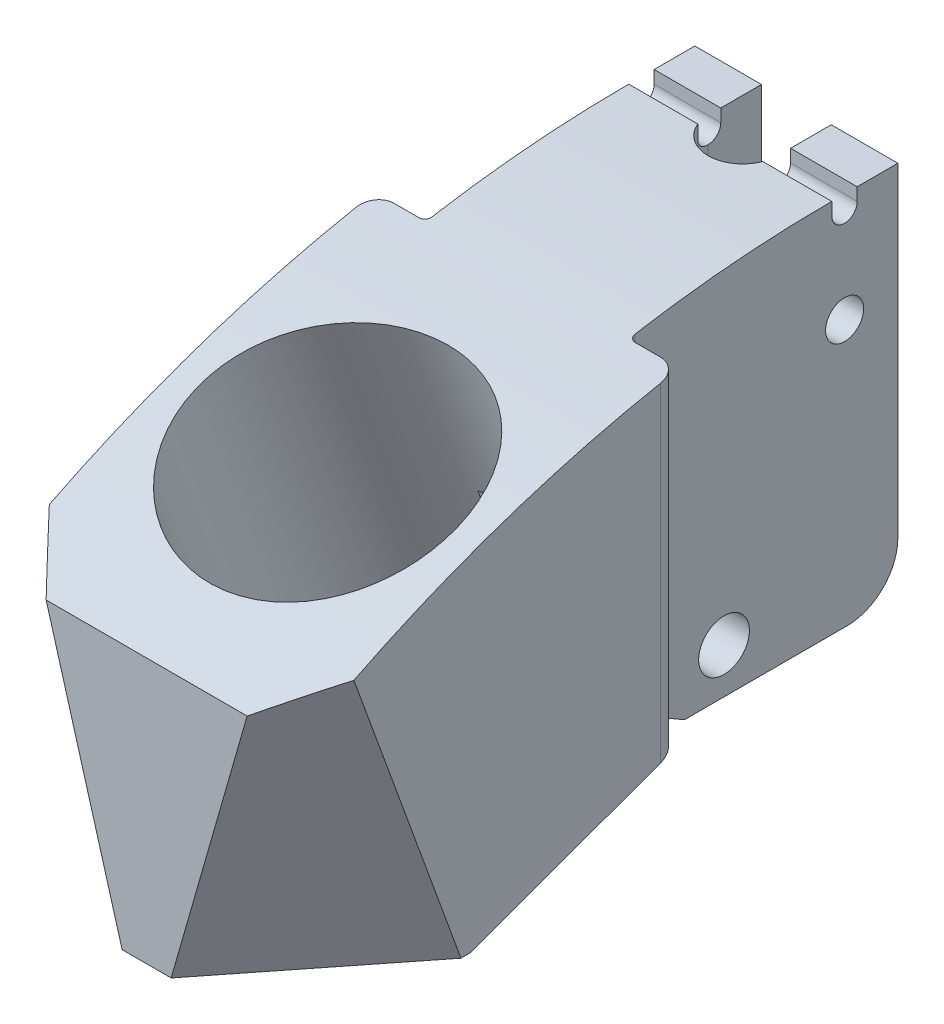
ISO-10303-21;
HEADER;
FILE_DESCRIPTION(('STEP AP214'),'2;1');
FILE_NAME('part.step','',(''),(''),'','','');
FILE_SCHEMA(('AUTOMOTIVE_DESIGN { 1 0 10303 214 1 1 1 1 }'));
ENDSEC;
DATA;
#1=APPLICATION_CONTEXT('core data for automotive mechanical design processes');
#2=APPLICATION_PROTOCOL_DEFINITION('international standard','automotive_design',2000,#1);
#3=PRODUCT_CONTEXT('',#1,'mechanical');
#4=PRODUCT('Part','Part','',(#3));
#5=PRODUCT_RELATED_PRODUCT_CATEGORY('part','',(#4));
#6=PRODUCT_DEFINITION_FORMATION('','',#4);
#7=PRODUCT_DEFINITION_CONTEXT('part definition',#1,'design');
#8=PRODUCT_DEFINITION('design','',#6,#7);
#9=PRODUCT_DEFINITION_SHAPE('','',#8);
#10=(LENGTH_UNIT() NAMED_UNIT(*) SI_UNIT(.MILLI.,.METRE.));
#11=(NAMED_UNIT(*) PLANE_ANGLE_UNIT() SI_UNIT($,.RADIAN.));
#12=(NAMED_UNIT(*) SI_UNIT($,.STERADIAN.) SOLID_ANGLE_UNIT());
#13=UNCERTAINTY_MEASURE_WITH_UNIT(LENGTH_MEASURE(1.E-05),#10,'distance_accuracy_value','');
#14=(GEOMETRIC_REPRESENTATION_CONTEXT(3) GLOBAL_UNCERTAINTY_ASSIGNED_CONTEXT((#13)) GLOBAL_UNIT_ASSIGNED_CONTEXT((#10,
#11,#12)) REPRESENTATION_CONTEXT('',''));
#15=CARTESIAN_POINT('',(0.,0.,0.));
#16=DIRECTION('',(0.,0.,1.));
#17=DIRECTION('',(1.,0.,0.));
#18=AXIS2_PLACEMENT_3D('',#15,#16,#17);
#19=CARTESIAN_POINT('',(-4.365625,131.7625,-1.5875));
#20=DIRECTION('',(0.,-1.,0.));
#21=DIRECTION('',(0.,0.,-1.));
#22=AXIS2_PLACEMENT_3D('',#19,#20,#21);
#23=PLANE('',#22);
#24=DIRECTION('',(0.,0.,-1.));
#25=VECTOR('',#24,1.);
#26=CARTESIAN_POINT('',(-4.365625,131.7625,-1.5875));
#27=LINE('',#26,#25);
#28=CARTESIAN_POINT('',(-4.365625,131.7625,-2.07673855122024));
#29=VERTEX_POINT('',#28);
#30=CARTESIAN_POINT('',(-4.365625,131.7625,-8.255));
#31=VERTEX_POINT('',#30);
#32=EDGE_CURVE('E904',#29,#31,#27,.T.);
#33=ORIENTED_EDGE('',*,*,#32,.F.);
#34=DIRECTION('',(1.,0.,0.));
#35=VECTOR('',#34,1.);
#36=CARTESIAN_POINT('',(12.7,131.7625,-2.07673855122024));
#37=LINE('',#36,#35);
#38=CARTESIAN_POINT('',(-1.95913708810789,131.7625,-2.07673855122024));
#39=VERTEX_POINT('',#38);
#40=EDGE_CURVE('E1398',#29,#39,#37,.T.);
#41=ORIENTED_EDGE('',*,*,#40,.T.);
#42=CARTESIAN_POINT('',(0.,131.7625,-1.5875));
#43=DIRECTION('',(0.,1.,0.));
#44=DIRECTION('',(0.,0.,1.));
#45=AXIS2_PLACEMENT_3D('',#42,#43,#44);
#46=CIRCLE('',#45,2.01929999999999);
#47=CARTESIAN_POINT('',(1.95913708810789,131.7625,-2.07673855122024));
#48=VERTEX_POINT('',#47);
#49=EDGE_CURVE('E398',#48,#39,#46,.T.);
#50=ORIENTED_EDGE('',*,*,#49,.F.);
#51=CARTESIAN_POINT('',(4.365625,131.7625,-2.07673855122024));
#52=VERTEX_POINT('',#51);
#53=EDGE_CURVE('E135',#48,#52,#37,.T.);
#54=ORIENTED_EDGE('',*,*,#53,.T.);
#55=DIRECTION('',(0.,0.,-1.));
#56=VECTOR('',#55,1.);
#57=CARTESIAN_POINT('',(4.365625,131.7625,-1.5875));
#58=LINE('',#57,#56);
#59=CARTESIAN_POINT('',(4.365625,131.7625,-8.255));
#60=VERTEX_POINT('',#59);
#61=EDGE_CURVE('E905',#52,#60,#58,.T.);
#62=ORIENTED_EDGE('',*,*,#61,.T.);
#63=DIRECTION('',(1.,0.,0.));
#64=VECTOR('',#63,1.);
#65=CARTESIAN_POINT('',(19.05,131.7625,-8.255));
#66=LINE('',#65,#64);
#67=EDGE_CURVE('E635',#31,#60,#66,.T.);
#68=ORIENTED_EDGE('',*,*,#67,.F.);
#69=EDGE_LOOP('',(#33,#41,#50,#54,#62,#68));
#70=FACE_BOUND('',#69,.T.);
#71=ADVANCED_FACE('F107',(#70),#23,.F.);
#72=CARTESIAN_POINT('',(19.05,107.10545,-8.255));
#73=DIRECTION('',(0.,0.,1.));
#74=DIRECTION('',(1.,0.,0.));
#75=AXIS2_PLACEMENT_3D('',#72,#73,#74);
#76=PLANE('',#75);
#77=CARTESIAN_POINT('',(7.9375,142.875,-8.255));
#78=DIRECTION('',(0.,0.,-1.));
#79=DIRECTION('',(-1.,0.,0.));
#80=AXIS2_PLACEMENT_3D('',#77,#78,#79);
#81=CIRCLE('',#80,1.35255);
#82=CARTESIAN_POINT('',(6.58495,142.875,-8.255));
#83=VERTEX_POINT('',#82);
#84=EDGE_CURVE('E573',#83,#83,#81,.T.);
#85=ORIENTED_EDGE('',*,*,#84,.F.);
#86=EDGE_LOOP('',(#85));
#87=FACE_BOUND('',#86,.T.);
#88=CARTESIAN_POINT('',(-7.9375,142.875,-8.255));
#89=DIRECTION('',(0.,0.,-1.));
#90=DIRECTION('',(-1.,0.,0.));
#91=AXIS2_PLACEMENT_3D('',#88,#89,#90);
#92=CIRCLE('',#91,1.35255);
#93=CARTESIAN_POINT('',(-9.29005,142.875,-8.255));
#94=VERTEX_POINT('',#93);
#95=EDGE_CURVE('E582',#94,#94,#92,.T.);
#96=ORIENTED_EDGE('',*,*,#95,.F.);
#97=EDGE_LOOP('',(#96));
#98=FACE_BOUND('',#97,.T.);
#99=CARTESIAN_POINT('',(-7.9375,111.125,-8.255));
#100=DIRECTION('',(0.,0.,-1.));
#101=DIRECTION('',(-1.,0.,0.));
#102=AXIS2_PLACEMENT_3D('',#99,#100,#101);
#103=CIRCLE('',#102,1.35255);
#104=CARTESIAN_POINT('',(-9.29005,111.125,-8.255));
#105=VERTEX_POINT('',#104);
#106=EDGE_CURVE('E588',#105,#105,#103,.T.);
#107=ORIENTED_EDGE('',*,*,#106,.F.);
#108=EDGE_LOOP('',(#107));
#109=FACE_BOUND('',#108,.T.);
#110=CARTESIAN_POINT('',(7.9375,111.125,-8.255));
#111=DIRECTION('',(0.,0.,-1.));
#112=DIRECTION('',(-1.,0.,0.));
#113=AXIS2_PLACEMENT_3D('',#110,#111,#112);
#114=CIRCLE('',#113,1.35255);
#115=CARTESIAN_POINT('',(6.58495,111.125,-8.255));
#116=VERTEX_POINT('',#115);
#117=EDGE_CURVE('E594',#116,#116,#114,.T.);
#118=ORIENTED_EDGE('',*,*,#117,.F.);
#119=EDGE_LOOP('',(#118));
#120=FACE_BOUND('',#119,.T.);
#121=DIRECTION('',(0.,-1.,0.));
#122=VECTOR('',#121,1.);
#123=CARTESIAN_POINT('',(-12.7,107.10545,-8.255));
#124=LINE('',#123,#122);
#125=CARTESIAN_POINT('',(-12.7,147.701,-8.255));
#126=VERTEX_POINT('',#125);
#127=CARTESIAN_POINT('',(-12.7,107.10545,-8.255));
#128=VERTEX_POINT('',#127);
#129=EDGE_CURVE('E416',#126,#128,#124,.T.);
#130=ORIENTED_EDGE('',*,*,#129,.F.);
#131=DIRECTION('',(-1.,0.,0.));
#132=VECTOR('',#131,1.);
#133=CARTESIAN_POINT('',(19.05,147.701,-8.255));
#134=LINE('',#133,#132);
#135=CARTESIAN_POINT('',(-4.365625,147.701,-8.255));
#136=VERTEX_POINT('',#135);
#137=EDGE_CURVE('E779',#136,#126,#134,.T.);
#138=ORIENTED_EDGE('',*,*,#137,.F.);
#139=DIRECTION('',(0.,-1.,0.));
#140=VECTOR('',#139,1.);
#141=CARTESIAN_POINT('',(-4.365625,107.10545,-8.255));
#142=LINE('',#141,#140);
#143=EDGE_CURVE('E774',#136,#31,#142,.T.);
#144=ORIENTED_EDGE('',*,*,#143,.T.);
#145=ORIENTED_EDGE('',*,*,#67,.T.);
#146=DIRECTION('',(0.,-1.,0.));
#147=VECTOR('',#146,1.);
#148=CARTESIAN_POINT('',(4.365625,107.10545,-8.255));
#149=LINE('',#148,#147);
#150=CARTESIAN_POINT('',(4.365625,147.701,-8.255));
#151=VERTEX_POINT('',#150);
#152=EDGE_CURVE('E907',#151,#60,#149,.T.);
#153=ORIENTED_EDGE('',*,*,#152,.F.);
#154=CARTESIAN_POINT('',(12.7,147.701,-8.255));
#155=VERTEX_POINT('',#154);
#156=EDGE_CURVE('E780',#155,#151,#134,.T.);
#157=ORIENTED_EDGE('',*,*,#156,.F.);
#158=DIRECTION('',(0.,1.,0.));
#159=VECTOR('',#158,1.);
#160=CARTESIAN_POINT('',(12.7,107.10545,-8.255));
#161=LINE('',#160,#159);
#162=CARTESIAN_POINT('',(12.7,107.10545,-8.255));
#163=VERTEX_POINT('',#162);
#164=EDGE_CURVE('E426',#163,#155,#161,.T.);
#165=ORIENTED_EDGE('',*,*,#164,.F.);
#166=DIRECTION('',(-1.,0.,0.));
#167=VECTOR('',#166,1.);
#168=CARTESIAN_POINT('',(19.05,107.10545,-8.255));
#169=LINE('',#168,#167);
#170=CARTESIAN_POINT('',(3.571875,107.10545,-8.255));
#171=VERTEX_POINT('',#170);
#172=EDGE_CURVE('E631',#163,#171,#169,.T.);
#173=ORIENTED_EDGE('',*,*,#172,.T.);
#174=DIRECTION('',(0.,-1.,0.));
#175=VECTOR('',#174,1.);
#176=CARTESIAN_POINT('',(3.571875,107.10545,-8.255));
#177=LINE('',#176,#175);
#178=CARTESIAN_POINT('',(3.571875,122.2375,-8.255));
#179=VERTEX_POINT('',#178);
#180=EDGE_CURVE('E616',#179,#171,#177,.T.);
#181=ORIENTED_EDGE('',*,*,#180,.F.);
#182=DIRECTION('',(-1.,0.,0.));
#183=VECTOR('',#182,1.);
#184=CARTESIAN_POINT('',(19.05,122.2375,-8.255));
#185=LINE('',#184,#183);
#186=CARTESIAN_POINT('',(-3.571875,122.2375,-8.255));
#187=VERTEX_POINT('',#186);
#188=EDGE_CURVE('E882',#179,#187,#185,.T.);
#189=ORIENTED_EDGE('',*,*,#188,.T.);
#190=DIRECTION('',(0.,-1.,0.));
#191=VECTOR('',#190,1.);
#192=CARTESIAN_POINT('',(-3.571875,107.10545,-8.255));
#193=LINE('',#192,#191);
#194=CARTESIAN_POINT('',(-3.571875,107.10545,-8.255));
#195=VERTEX_POINT('',#194);
#196=EDGE_CURVE('E892',#187,#195,#193,.T.);
#197=ORIENTED_EDGE('',*,*,#196,.T.);
#198=EDGE_CURVE('E795',#195,#128,#169,.T.);
#199=ORIENTED_EDGE('',*,*,#198,.T.);
#200=EDGE_LOOP('',(#130,#138,#144,#145,#153,#157,#165,#173,#181,#189,#197,#199));
#201=FACE_BOUND('',#200,.T.);
#202=ADVANCED_FACE('F832',(#87,#98,#109,#120,#201),#76,.F.);
#203=CARTESIAN_POINT('',(-19.05,0.,0.));
#204=DIRECTION('',(1.,0.,0.));
#205=DIRECTION('',(0.,0.,-1.));
#206=AXIS2_PLACEMENT_3D('',#203,#204,#205);
#207=CYLINDRICAL_SURFACE('',#206,147.701);
#208=DIRECTION('',(1.,0.,0.));
#209=VECTOR('',#208,1.);
#210=CARTESIAN_POINT('',(-19.05,147.701,0.0127000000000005));
#211=LINE('',#210,#209);
#212=CARTESIAN_POINT('',(-12.7,147.701,0.0127000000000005));
#213=VERTEX_POINT('',#212);
#214=CARTESIAN_POINT('',(-4.06177813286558,147.701,0.0127000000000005));
#215=VERTEX_POINT('',#214);
#216=EDGE_CURVE('E535',#213,#215,#211,.T.);
#217=ORIENTED_EDGE('',*,*,#216,.F.);
#218=CARTESIAN_POINT('',(-12.7,0.,0.));
#219=DIRECTION('',(-1.,0.,0.));
#220=DIRECTION('',(0.,0.,1.));
#221=AXIS2_PLACEMENT_3D('',#218,#219,#220);
#222=CIRCLE('',#221,147.701);
#223=CARTESIAN_POINT('',(-12.7,145.636938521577,24.60625));
#224=VERTEX_POINT('',#223);
#225=EDGE_CURVE('E418',#213,#224,#222,.F.);
#226=ORIENTED_EDGE('',*,*,#225,.T.);
#227=CARTESIAN_POINT('',(-12.7,145.636938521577,24.60625));
#228=CARTESIAN_POINT('',(-12.6999644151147,145.629311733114,24.6513955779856));
#229=CARTESIAN_POINT('',(-12.7038495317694,145.621663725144,24.6965292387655));
#230=CARTESIAN_POINT('',(-12.7191988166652,145.606546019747,24.7855023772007));
#231=CARTESIAN_POINT('',(-12.7306600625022,145.599076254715,24.8293423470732));
#232=CARTESIAN_POINT('',(-12.7609087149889,145.584525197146,24.9145200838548));
#233=CARTESIAN_POINT('',(-12.7797005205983,145.577444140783,24.9558563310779));
#234=CARTESIAN_POINT('',(-12.8240934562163,145.563890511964,25.0347914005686));
#235=CARTESIAN_POINT('',(-12.849692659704,145.557417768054,25.0723912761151));
#236=CARTESIAN_POINT('',(-12.9068320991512,145.545318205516,25.1425339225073));
#237=CARTESIAN_POINT('',(-12.9383348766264,145.539686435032,25.1751063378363));
#238=CARTESIAN_POINT('',(-13.0065200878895,145.529401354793,25.2344933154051));
#239=CARTESIAN_POINT('',(-13.0432033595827,145.524748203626,25.2613069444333));
#240=CARTESIAN_POINT('',(-13.120166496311,145.51663248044,25.3080151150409));
#241=CARTESIAN_POINT('',(-13.1603909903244,145.513154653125,25.3279983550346));
#242=CARTESIAN_POINT('',(-13.2436952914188,145.507422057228,25.3609110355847));
#243=CARTESIAN_POINT('',(-13.2867727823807,145.505166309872,25.3738461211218));
#244=CARTESIAN_POINT('',(-13.3574356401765,145.502577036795,25.3886885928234));
#245=CARTESIAN_POINT('',(-13.3845384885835,145.501837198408,25.3929278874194));
#246=CARTESIAN_POINT('',(-13.4390066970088,145.500850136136,25.3985829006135));
#247=CARTESIAN_POINT('',(-13.4663716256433,145.500602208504,25.4000026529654));
#248=CARTESIAN_POINT('',(-13.49375,145.500602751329,25.4));
#249=B_SPLINE_CURVE_WITH_KNOTS('',3,(#227,#228,#229,#230,#231,#232,#233,#234,#235,#236,#237,
#238,#239,#240,#241,#242,#243,#244,#245,#246,#247,#248),.UNSPECIFIED.,.F.,.F.,(4,2,2,2,2,2,2,2,
2,2,4),(0.,0.137180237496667,0.274307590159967,0.411517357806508,0.548688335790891,
0.685016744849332,0.821367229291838,0.955873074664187,1.09027103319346,1.17245967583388,
1.25453065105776),.UNSPECIFIED.);
#250=CARTESIAN_POINT('',(-13.49375,145.500602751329,25.4));
#251=VERTEX_POINT('',#250);
#252=EDGE_CURVE('E674',#224,#251,#249,.T.);
#253=ORIENTED_EDGE('',*,*,#252,.T.);
#254=DIRECTION('',(1.,0.,0.));
#255=VECTOR('',#254,1.);
#256=CARTESIAN_POINT('',(-19.05,145.500602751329,25.4));
#257=LINE('',#256,#255);
#258=CARTESIAN_POINT('',(-16.66875,145.500602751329,25.4));
#259=VERTEX_POINT('',#258);
#260=EDGE_CURVE('E420',#251,#259,#257,.F.);
#261=ORIENTED_EDGE('',*,*,#260,.T.);
#262=CARTESIAN_POINT('',(-16.66875,145.500602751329,25.4));
#263=CARTESIAN_POINT('',(-16.7349819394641,145.500603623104,25.3999930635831));
#264=CARTESIAN_POINT('',(-16.8012105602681,145.500120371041,25.4027632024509));
#265=CARTESIAN_POINT('',(-16.933188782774,145.498192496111,25.4138041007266));
#266=CARTESIAN_POINT('',(-16.9989384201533,145.496747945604,25.4220744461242));
#267=CARTESIAN_POINT('',(-17.1294214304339,145.492906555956,25.4440496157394));
#268=CARTESIAN_POINT('',(-17.1941558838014,145.49051081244,25.4577481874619));
#269=CARTESIAN_POINT('',(-17.3222063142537,145.484783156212,25.4904598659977));
#270=CARTESIAN_POINT('',(-17.3855223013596,145.481451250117,25.509472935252));
#271=CARTESIAN_POINT('',(-17.572716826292,145.470073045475,25.5743075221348));
#272=CARTESIAN_POINT('',(-17.6939131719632,145.460642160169,25.6279365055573));
#273=CARTESIAN_POINT('',(-17.9254397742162,145.43832099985,25.7543059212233));
#274=CARTESIAN_POINT('',(-18.0357707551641,145.425430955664,25.8270450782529));
#275=CARTESIAN_POINT('',(-18.243313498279,145.396398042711,25.9899924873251));
#276=CARTESIAN_POINT('',(-18.3404408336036,145.380235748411,26.0803049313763));
#277=CARTESIAN_POINT('',(-18.5181875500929,145.345088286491,26.2754738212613));
#278=CARTESIAN_POINT('',(-18.598803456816,145.326102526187,26.3803333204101));
#279=CARTESIAN_POINT('',(-18.742477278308,145.285474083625,26.6031843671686));
#280=CARTESIAN_POINT('',(-18.8052655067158,145.263797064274,26.7213433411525));
#281=CARTESIAN_POINT('',(-18.9101136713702,145.218547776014,26.9661686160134));
#282=CARTESIAN_POINT('',(-18.9521804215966,145.194976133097,27.0928321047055));
#283=CARTESIAN_POINT('',(-19.0055274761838,145.153583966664,27.3135710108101));
#284=CARTESIAN_POINT('',(-19.0221984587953,145.136078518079,27.4064418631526));
#285=CARTESIAN_POINT('',(-19.0444341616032,145.100672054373,27.5932874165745));
#286=CARTESIAN_POINT('',(-19.0500150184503,145.082771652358,27.6872603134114));
#287=CARTESIAN_POINT('',(-19.05,145.064770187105,27.78125));
#288=B_SPLINE_CURVE_WITH_KNOTS('',3,(#262,#263,#264,#265,#266,#267,#268,#269,#270,#271,#272,
#273,#274,#275,#276,#277,#278,#279,#280,#281,#282,#283,#284,#285,#286,#287),.UNSPECIFIED.,.F.,
.F.,(4,2,2,2,2,2,2,2,2,2,2,2,4),(0.,0.198630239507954,0.397245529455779,0.595632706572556,
0.794018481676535,1.19057588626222,1.58710683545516,1.98606468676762,2.38510640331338,
2.7898970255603,3.19455444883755,3.48183443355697,3.76869610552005),.UNSPECIFIED.);
#289=CARTESIAN_POINT('',(-19.05,145.064770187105,27.78125));
#290=VERTEX_POINT('',#289);
#291=EDGE_CURVE('E710',#259,#290,#288,.T.);
#292=ORIENTED_EDGE('',*,*,#291,.T.);
#293=CARTESIAN_POINT('',(-19.05,0.,0.));
#294=DIRECTION('',(1.,0.,0.));
#295=DIRECTION('',(0.,0.,-1.));
#296=AXIS2_PLACEMENT_3D('',#293,#294,#295);
#297=CIRCLE('',#296,147.701);
#298=CARTESIAN_POINT('',(-19.05,132.059674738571,66.1500393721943));
#299=VERTEX_POINT('',#298);
#300=EDGE_CURVE('E761',#290,#299,#297,.T.);
#301=ORIENTED_EDGE('',*,*,#300,.T.);
#302=CARTESIAN_POINT('',(-33.3093528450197,0.,0.));
#303=DIRECTION('',(0.766044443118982,0.219846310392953,-0.604022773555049));
#304=DIRECTION('',(0.642787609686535,-0.262002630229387,0.719846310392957));
#305=AXIS2_PLACEMENT_3D('',#302,#303,#304);
#306=ELLIPSE('',#305,192.809962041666,147.701);
#307=CARTESIAN_POINT('',(-12.574784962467,128.385882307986,73.025));
#308=VERTEX_POINT('',#307);
#309=EDGE_CURVE('E649',#308,#299,#306,.F.);
#310=ORIENTED_EDGE('',*,*,#309,.F.);
#311=DIRECTION('',(1.,0.,0.));
#312=VECTOR('',#311,1.);
#313=CARTESIAN_POINT('',(-19.05,128.385882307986,73.025));
#314=LINE('',#313,#312);
#315=CARTESIAN_POINT('',(12.574784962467,128.385882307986,73.025));
#316=VERTEX_POINT('',#315);
#317=EDGE_CURVE('E772',#308,#316,#314,.T.);
#318=ORIENTED_EDGE('',*,*,#317,.T.);
#319=CARTESIAN_POINT('',(33.3093528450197,0.,0.));
#320=DIRECTION('',(-0.766044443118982,0.219846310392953,-0.604022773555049));
#321=DIRECTION('',(0.642787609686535,0.262002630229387,-0.719846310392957));
#322=AXIS2_PLACEMENT_3D('',#319,#320,#321);
#323=ELLIPSE('',#322,192.809962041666,147.701);
#324=CARTESIAN_POINT('',(19.05,132.059674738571,66.1500393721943));
#325=VERTEX_POINT('',#324);
#326=EDGE_CURVE('E646',#325,#316,#323,.F.);
#327=ORIENTED_EDGE('',*,*,#326,.F.);
#328=CARTESIAN_POINT('',(19.05,0.,0.));
#329=DIRECTION('',(1.,0.,0.));
#330=DIRECTION('',(0.,0.,-1.));
#331=AXIS2_PLACEMENT_3D('',#328,#329,#330);
#332=CIRCLE('',#331,147.701);
#333=CARTESIAN_POINT('',(19.05,145.064770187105,27.78125));
#334=VERTEX_POINT('',#333);
#335=EDGE_CURVE('E769',#334,#325,#332,.T.);
#336=ORIENTED_EDGE('',*,*,#335,.F.);
#337=CARTESIAN_POINT('',(19.05,145.064770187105,27.78125));
#338=CARTESIAN_POINT('',(19.0499988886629,145.077745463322,27.7134986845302));
#339=CARTESIAN_POINT('',(19.0471067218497,145.090666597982,27.6457699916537));
#340=CARTESIAN_POINT('',(19.0355595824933,145.116324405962,27.5107706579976));
#341=CARTESIAN_POINT('',(19.0269046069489,145.129061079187,27.4435000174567));
#342=CARTESIAN_POINT('',(18.9923496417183,145.166852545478,27.2431406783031));
#343=CARTESIAN_POINT('',(18.957859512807,145.191517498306,27.1113545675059));
#344=CARTESIAN_POINT('',(18.8667982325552,145.239102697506,26.8552689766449));
#345=CARTESIAN_POINT('',(18.8102112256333,145.262021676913,26.7309749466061));
#346=CARTESIAN_POINT('',(18.6764383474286,145.305505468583,26.4935849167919));
#347=CARTESIAN_POINT('',(18.5992597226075,145.326071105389,26.3804849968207));
#348=CARTESIAN_POINT('',(18.4272025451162,145.364143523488,26.1698786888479));
#349=CARTESIAN_POINT('',(18.33249672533,145.38167717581,26.0722360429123));
#350=CARTESIAN_POINT('',(18.1275085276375,145.41348555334,25.8942429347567));
#351=CARTESIAN_POINT('',(18.0172235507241,145.427759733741,25.8138953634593));
#352=CARTESIAN_POINT('',(17.7860995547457,145.452494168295,25.6741565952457));
#353=CARTESIAN_POINT('',(17.6654524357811,145.463010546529,25.614457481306));
#354=CARTESIAN_POINT('',(17.4156339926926,145.480280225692,25.5161904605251));
#355=CARTESIAN_POINT('',(17.2864696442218,145.487036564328,25.477605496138));
#356=CARTESIAN_POINT('',(17.0750666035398,145.494752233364,25.4334966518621));
#357=CARTESIAN_POINT('',(16.9942722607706,145.496945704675,25.4209423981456));
#358=CARTESIAN_POINT('',(16.8319144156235,145.499870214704,25.4041963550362));
#359=CARTESIAN_POINT('',(16.7503522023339,145.500603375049,25.3999924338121));
#360=CARTESIAN_POINT('',(16.66875,145.500602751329,25.4));
#361=B_SPLINE_CURVE_WITH_KNOTS('',3,(#337,#338,#339,#340,#341,#342,#343,#344,#345,#346,#347,
#348,#349,#350,#351,#352,#353,#354,#355,#356,#357,#358,#359,#360),.UNSPECIFIED.,.F.,.F.,(4,2,2,
2,2,2,2,2,2,2,2,4),(0.,0.206822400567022,0.413644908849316,0.826837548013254,1.24032721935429,
1.65367156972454,2.063140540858,2.4726779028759,2.87581425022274,3.2786244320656,
3.52359756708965,3.76821453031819),.UNSPECIFIED.);
#362=CARTESIAN_POINT('',(16.66875,145.500602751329,25.4));
#363=VERTEX_POINT('',#362);
#364=EDGE_CURVE('E705',#334,#363,#361,.T.);
#365=ORIENTED_EDGE('',*,*,#364,.T.);
#366=DIRECTION('',(1.,0.,0.));
#367=VECTOR('',#366,1.);
#368=CARTESIAN_POINT('',(-19.05,145.500602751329,25.4));
#369=LINE('',#368,#367);
#370=CARTESIAN_POINT('',(13.49375,145.500602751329,25.4));
#371=VERTEX_POINT('',#370);
#372=EDGE_CURVE('E652',#363,#371,#369,.F.);
#373=ORIENTED_EDGE('',*,*,#372,.T.);
#374=CARTESIAN_POINT('',(13.49375,145.500602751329,25.4));
#375=CARTESIAN_POINT('',(13.4495716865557,145.500595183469,25.4000400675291));
#376=CARTESIAN_POINT('',(13.4054087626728,145.501246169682,25.3963142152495));
#377=CARTESIAN_POINT('',(13.3183923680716,145.503808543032,25.3816311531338));
#378=CARTESIAN_POINT('',(13.2755373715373,145.505718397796,25.3706827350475));
#379=CARTESIAN_POINT('',(13.1922884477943,145.51074288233,25.3418489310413));
#380=CARTESIAN_POINT('',(13.1518953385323,145.513857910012,25.3239612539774));
#381=CARTESIAN_POINT('',(13.0747058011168,145.52118823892,25.2818043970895));
#382=CARTESIAN_POINT('',(13.0379091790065,145.525403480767,25.2575355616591));
#383=CARTESIAN_POINT('',(12.9686756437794,145.534832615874,25.2031478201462));
#384=CARTESIAN_POINT('',(12.9362692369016,145.540052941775,25.1729912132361));
#385=CARTESIAN_POINT('',(12.8769621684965,145.551313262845,25.1078015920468));
#386=CARTESIAN_POINT('',(12.8500627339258,145.55735344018,25.0727674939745));
#387=CARTESIAN_POINT('',(12.8021356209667,145.570162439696,24.9982930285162));
#388=CARTESIAN_POINT('',(12.7811966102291,145.576940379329,24.9587972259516));
#389=CARTESIAN_POINT('',(12.746254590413,145.590952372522,24.8769312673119));
#390=CARTESIAN_POINT('',(12.7322488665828,145.598186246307,24.8345622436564));
#391=CARTESIAN_POINT('',(12.7146149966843,145.610703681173,24.761044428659));
#392=CARTESIAN_POINT('',(12.7091380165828,145.615925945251,24.730315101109));
#393=CARTESIAN_POINT('',(12.7018306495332,145.626414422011,24.66847821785));
#394=CARTESIAN_POINT('',(12.6999951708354,145.631680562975,24.6373712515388));
#395=CARTESIAN_POINT('',(12.7,145.636938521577,24.60625));
#396=B_SPLINE_CURVE_WITH_KNOTS('',3,(#374,#375,#376,#377,#378,#379,#380,#381,#382,#383,#384,
#385,#386,#387,#388,#389,#390,#391,#392,#393,#394,#395),.UNSPECIFIED.,.F.,.F.,(4,2,2,2,2,2,2,2,
2,2,4),(0.,0.132350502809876,0.264540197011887,0.396773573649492,0.528999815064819,
0.662102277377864,0.795234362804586,0.930254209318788,1.06522114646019,1.15996260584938,
1.25457149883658),.UNSPECIFIED.);
#397=CARTESIAN_POINT('',(12.7,145.636938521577,24.60625));
#398=VERTEX_POINT('',#397);
#399=EDGE_CURVE('E697',#371,#398,#396,.T.);
#400=ORIENTED_EDGE('',*,*,#399,.T.);
#401=CARTESIAN_POINT('',(12.7,0.,0.));
#402=DIRECTION('',(1.,0.,0.));
#403=DIRECTION('',(0.,0.,-1.));
#404=AXIS2_PLACEMENT_3D('',#401,#402,#403);
#405=CIRCLE('',#404,147.701);
#406=CARTESIAN_POINT('',(12.7,147.701,0.0127000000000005));
#407=VERTEX_POINT('',#406);
#408=EDGE_CURVE('E654',#398,#407,#405,.F.);
#409=ORIENTED_EDGE('',*,*,#408,.T.);
#410=CARTESIAN_POINT('',(4.06177813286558,147.701,0.0127000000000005));
#411=VERTEX_POINT('',#410);
#412=EDGE_CURVE('E536',#411,#407,#211,.T.);
#413=ORIENTED_EDGE('',*,*,#412,.F.);
#414=CARTESIAN_POINT('',(-4.06675858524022,147.701,0.));
#415=CARTESIAN_POINT('',(-4.02212559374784,147.701001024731,0.114374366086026));
#416=CARTESIAN_POINT('',(-3.97264458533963,147.70086716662,0.226854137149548));
#417=CARTESIAN_POINT('',(-3.86439367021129,147.700363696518,0.447244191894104));
#418=CARTESIAN_POINT('',(-3.80562422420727,147.699994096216,0.555154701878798));
#419=CARTESIAN_POINT('',(-3.67924446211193,147.699053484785,0.765561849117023));
#420=CARTESIAN_POINT('',(-3.61164052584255,147.698482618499,0.868062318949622));
#421=CARTESIAN_POINT('',(-3.46804408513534,147.697179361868,1.06700542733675));
#422=CARTESIAN_POINT('',(-3.39205167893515,147.696446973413,1.16344813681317));
#423=CARTESIAN_POINT('',(-3.23219422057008,147.694863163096,1.34961768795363));
#424=CARTESIAN_POINT('',(-3.14832698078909,147.694011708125,1.43934265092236));
#425=CARTESIAN_POINT('',(-2.97330160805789,147.692234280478,1.61144163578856));
#426=CARTESIAN_POINT('',(-2.88214079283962,147.691308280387,1.69381292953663));
#427=CARTESIAN_POINT('',(-2.69325570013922,147.689427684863,1.8505382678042));
#428=CARTESIAN_POINT('',(-2.59553508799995,147.68847310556,1.92489673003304));
#429=CARTESIAN_POINT('',(-2.39414220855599,147.686578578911,2.06514667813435));
#430=CARTESIAN_POINT('',(-2.29046775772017,147.685638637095,2.13103502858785));
#431=CARTESIAN_POINT('',(-2.07795653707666,147.683815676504,2.25383241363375));
#432=CARTESIAN_POINT('',(-1.96912076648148,147.682932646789,2.3107431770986));
#433=CARTESIAN_POINT('',(-1.74700324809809,147.68126104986,2.41521555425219));
#434=CARTESIAN_POINT('',(-1.63371987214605,147.680472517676,2.46277370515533));
#435=CARTESIAN_POINT('',(-1.40356806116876,147.679023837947,2.5481659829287));
#436=CARTESIAN_POINT('',(-1.28670051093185,147.678363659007,2.58600248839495));
#437=CARTESIAN_POINT('',(-1.05017978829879,147.677198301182,2.65170914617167));
#438=CARTESIAN_POINT('',(-0.930525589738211,147.676693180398,2.6795755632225));
#439=CARTESIAN_POINT('',(-0.568799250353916,147.675444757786,2.74784622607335));
#440=CARTESIAN_POINT('',(-0.323677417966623,147.674966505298,2.77302764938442));
#441=CARTESIAN_POINT('',(0.167313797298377,147.674801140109,2.78182211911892));
#442=CARTESIAN_POINT('',(0.413183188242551,147.675114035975,2.7654347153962));
#443=CARTESIAN_POINT('',(0.777102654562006,147.676134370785,2.71016419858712));
#444=CARTESIAN_POINT('',(0.897655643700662,147.676566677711,2.68660581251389));
#445=CARTESIAN_POINT('',(1.13633400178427,147.677596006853,2.62942549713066));
#446=CARTESIAN_POINT('',(1.25446026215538,147.678192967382,2.59580733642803));
#447=CARTESIAN_POINT('',(1.48747547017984,147.679527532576,2.51873517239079));
#448=CARTESIAN_POINT('',(1.60236378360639,147.68026516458,2.47527925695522));
#449=CARTESIAN_POINT('',(1.82803146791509,147.681849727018,2.37886235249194));
#450=CARTESIAN_POINT('',(1.93881233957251,147.682696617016,2.3259048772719));
#451=CARTESIAN_POINT('',(2.15556147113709,147.684464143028,2.21082836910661));
#452=CARTESIAN_POINT('',(2.26152789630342,147.685384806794,2.1487058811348));
#453=CARTESIAN_POINT('',(2.46781316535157,147.687258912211,2.01578045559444));
#454=CARTESIAN_POINT('',(2.56813406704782,147.688212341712,1.94498071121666));
#455=CARTESIAN_POINT('',(2.76252777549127,147.690109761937,1.79513106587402));
#456=CARTESIAN_POINT('',(2.85659608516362,147.691053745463,1.71607532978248));
#457=CARTESIAN_POINT('',(3.03770499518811,147.692886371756,1.55034852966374));
#458=CARTESIAN_POINT('',(3.12474790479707,147.693775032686,1.46367998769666));
#459=CARTESIAN_POINT('',(3.29998362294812,147.695540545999,1.27382514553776));
#460=CARTESIAN_POINT('',(3.38733513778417,147.696406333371,1.16986023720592));
#461=CARTESIAN_POINT('',(3.55199151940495,147.697956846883,0.954240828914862));
#462=CARTESIAN_POINT('',(3.62929512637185,147.69864155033,0.842585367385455));
#463=CARTESIAN_POINT('',(3.77329982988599,147.699775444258,0.612351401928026));
#464=CARTESIAN_POINT('',(3.83998151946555,147.700224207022,0.493760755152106));
#465=CARTESIAN_POINT('',(3.9620104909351,147.700837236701,0.250888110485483));
#466=CARTESIAN_POINT('',(4.01735804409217,147.701001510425,0.126606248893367));
#467=CARTESIAN_POINT('',(4.06675858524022,147.701,0.));
#468=B_SPLINE_CURVE_WITH_KNOTS('',3,(#414,#415,#416,#417,#418,#419,#420,#421,#422,#423,#424,
#425,#426,#427,#428,#429,#430,#431,#432,#433,#434,#435,#436,#437,#438,#439,#440,#441,#442,#443,
#444,#445,#446,#447,#448,#449,#450,#451,#452,#453,#454,#455,#456,#457,#458,#459,#460,#461,#462,
#463,#464,#465,#466,#467),.UNSPECIFIED.,.F.,.F.,(4,2,2,2,2,2,2,2,2,2,2,2,2,2,2,2,2,2,2,2,2,2,2,
2,2,2,4),(0.,0.368211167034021,0.736404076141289,1.10433254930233,1.47225671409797,
1.8402833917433,2.20844604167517,2.57640466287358,2.94449910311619,3.31252257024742,
3.680682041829,4.04875134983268,4.41695840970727,5.15246952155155,5.88798859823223,
6.25612613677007,6.62412593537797,6.99219732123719,7.36013286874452,7.72820747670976,
8.09614703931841,8.46434843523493,8.83242830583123,9.23920777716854,9.64603820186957,
10.053603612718,10.4611592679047),.UNSPECIFIED.);
#469=EDGE_CURVE('E452',#215,#411,#468,.T.);
#470=ORIENTED_EDGE('',*,*,#469,.F.);
#471=EDGE_LOOP('',(#217,#226,#253,#261,#292,#301,#310,#318,#327,#336,#365,#373,#400,#409,#413,#470));
#472=FACE_BOUND('',#471,.T.);
#473=CARTESIAN_POINT('',(0.,143.419103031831,35.306462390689));
#474=CARTESIAN_POINT('',(-0.444626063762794,143.419103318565,35.3064576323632));
#475=CARTESIAN_POINT('',(-0.889183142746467,143.414613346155,35.3247140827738));
#476=CARTESIAN_POINT('',(-1.77526631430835,143.396644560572,35.3975875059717));
#477=CARTESIAN_POINT('',(-2.21679166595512,143.383163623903,35.4522130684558));
#478=CARTESIAN_POINT('',(-3.09393697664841,143.347171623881,35.5974628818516));
#479=CARTESIAN_POINT('',(-3.52955080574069,143.324651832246,35.6881219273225));
#480=CARTESIAN_POINT('',(-4.39134938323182,143.270549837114,35.904698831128));
#481=CARTESIAN_POINT('',(-4.81753414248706,143.238967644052,36.0306166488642));
#482=CARTESIAN_POINT('',(-5.6571865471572,143.166725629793,36.3166048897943));
#483=CARTESIAN_POINT('',(-6.07066213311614,143.126071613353,36.4766534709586));
#484=CARTESIAN_POINT('',(-6.88227919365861,143.035636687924,36.8296784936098));
#485=CARTESIAN_POINT('',(-7.2804204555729,142.985855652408,37.0226553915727));
#486=CARTESIAN_POINT('',(-8.05849812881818,142.877150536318,37.4399748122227));
#487=CARTESIAN_POINT('',(-8.43843821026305,142.818228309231,37.6643109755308));
#488=CARTESIAN_POINT('',(-9.17755313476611,142.691225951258,38.142635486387));
#489=CARTESIAN_POINT('',(-9.53672798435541,142.623145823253,38.3966238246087));
#490=CARTESIAN_POINT('',(-10.2331125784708,142.477580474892,38.9333022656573));
#491=CARTESIAN_POINT('',(-10.5702355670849,142.400061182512,39.2160957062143));
#492=CARTESIAN_POINT('',(-11.2186892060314,142.235888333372,39.8074314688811));
#493=CARTESIAN_POINT('',(-11.5300197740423,142.149234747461,40.1159738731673));
#494=CARTESIAN_POINT('',(-12.1247183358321,141.966915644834,40.7564855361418));
#495=CARTESIAN_POINT('',(-12.4080850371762,141.871249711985,41.0884558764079));
#496=CARTESIAN_POINT('',(-12.9448427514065,141.671107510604,41.7733161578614));
#497=CARTESIAN_POINT('',(-13.1982337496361,141.566631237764,42.1262061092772));
#498=CARTESIAN_POINT('',(-13.6738217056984,141.348886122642,42.8511534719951));
#499=CARTESIAN_POINT('',(-13.8959411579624,141.23559647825,43.2232554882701));
#500=CARTESIAN_POINT('',(-14.3066552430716,141.000831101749,43.9830547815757));
#501=CARTESIAN_POINT('',(-14.4952498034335,140.879355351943,44.370752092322));
#502=CARTESIAN_POINT('',(-14.8375417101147,140.628712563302,45.1588480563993));
#503=CARTESIAN_POINT('',(-14.9912398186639,140.499545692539,45.559246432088));
#504=CARTESIAN_POINT('',(-15.2626181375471,140.234127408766,46.3697826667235));
#505=CARTESIAN_POINT('',(-15.3802984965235,140.097876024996,46.779920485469));
#506=CARTESIAN_POINT('',(-15.5783876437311,139.819561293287,47.6053002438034));
#507=CARTESIAN_POINT('',(-15.6589393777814,139.677522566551,48.0205161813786));
#508=CARTESIAN_POINT('',(-15.7828488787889,139.387985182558,48.8545785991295));
#509=CARTESIAN_POINT('',(-15.8262067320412,139.240486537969,49.2734250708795));
#510=CARTESIAN_POINT('',(-15.8754067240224,138.94099736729,50.1117026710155));
#511=CARTESIAN_POINT('',(-15.8812498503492,138.789006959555,50.5311337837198));
#512=CARTESIAN_POINT('',(-15.8553795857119,138.481608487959,51.3675777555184));
#513=CARTESIAN_POINT('',(-15.8236662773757,138.326200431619,51.7845906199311));
#514=CARTESIAN_POINT('',(-15.7231272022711,138.01379656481,52.611518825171));
#515=CARTESIAN_POINT('',(-15.6544554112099,137.856809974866,53.0214563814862));
#516=CARTESIAN_POINT('',(-15.4806024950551,137.541878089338,53.833137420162));
#517=CARTESIAN_POINT('',(-15.37542148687,137.383932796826,54.234880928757));
#518=CARTESIAN_POINT('',(-15.1293148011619,137.068414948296,55.0274200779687));
#519=CARTESIAN_POINT('',(-14.9883887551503,136.910842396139,55.4182156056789));
#520=CARTESIAN_POINT('',(-14.6718105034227,136.597463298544,56.1862122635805));
#521=CARTESIAN_POINT('',(-14.4961581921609,136.441656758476,56.5634133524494));
#522=CARTESIAN_POINT('',(-14.1109972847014,136.132931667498,57.3024522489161));
#523=CARTESIAN_POINT('',(-13.9014211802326,135.980019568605,57.6642575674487));
#524=CARTESIAN_POINT('',(-13.4501585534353,135.678870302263,58.3693115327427));
#525=CARTESIAN_POINT('',(-13.2084720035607,135.530633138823,58.7125601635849));
#526=CARTESIAN_POINT('',(-12.6946877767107,135.240294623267,59.3782789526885));
#527=CARTESIAN_POINT('',(-12.4225892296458,135.098193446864,59.7007485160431));
#528=CARTESIAN_POINT('',(-11.8498937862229,134.821578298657,60.3228259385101));
#529=CARTESIAN_POINT('',(-11.5492967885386,134.687064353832,60.6224337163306));
#530=CARTESIAN_POINT('',(-10.9201111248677,134.426374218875,61.1983312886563));
#531=CARTESIAN_POINT('',(-10.5913885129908,134.300243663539,61.4744954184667));
#532=CARTESIAN_POINT('',(-9.90958052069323,134.058439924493,62.0000304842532));
#533=CARTESIAN_POINT('',(-9.55649505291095,133.942766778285,62.2494013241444));
#534=CARTESIAN_POINT('',(-8.82843838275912,133.723165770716,62.7197555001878));
#535=CARTESIAN_POINT('',(-8.45346709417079,133.61923795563,62.9407387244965));
#536=CARTESIAN_POINT('',(-7.68427693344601,133.424312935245,63.3529013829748));
#537=CARTESIAN_POINT('',(-7.29005808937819,133.333315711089,63.5440808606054));
#538=CARTESIAN_POINT('',(-6.48504560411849,133.165288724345,63.8954555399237));
#539=CARTESIAN_POINT('',(-6.07424753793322,133.088262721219,64.0556424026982));
#540=CARTESIAN_POINT('',(-5.23909005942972,132.949123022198,64.343933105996));
#541=CARTESIAN_POINT('',(-4.81473063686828,132.887009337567,64.4720369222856));
#542=CARTESIAN_POINT('',(-3.95549028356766,132.778445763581,64.6953257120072));
#543=CARTESIAN_POINT('',(-3.52060965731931,132.731995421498,64.790511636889));
#544=CARTESIAN_POINT('',(-2.64343391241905,132.655324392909,64.9473474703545));
#545=CARTESIAN_POINT('',(-2.20113882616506,132.625103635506,65.0089975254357));
#546=CARTESIAN_POINT('',(-1.31453912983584,132.581374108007,65.0981343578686));
#547=CARTESIAN_POINT('',(-0.870255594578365,132.567782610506,65.1257902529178));
#548=CARTESIAN_POINT('',(0.0193258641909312,132.557203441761,65.147320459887));
#549=CARTESIAN_POINT('',(0.464623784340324,132.56021571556,65.1411948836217));
#550=CARTESIAN_POINT('',(1.35304434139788,132.58280678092,65.0952025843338));
#551=CARTESIAN_POINT('',(1.79616701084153,132.602385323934,65.0553363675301));
#552=CARTESIAN_POINT('',(2.6770804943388,132.657868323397,64.9421229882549));
#553=CARTESIAN_POINT('',(3.1148713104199,132.693772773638,64.8687758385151));
#554=CARTESIAN_POINT('',(3.98094022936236,132.781362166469,64.6892973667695));
#555=CARTESIAN_POINT('',(4.40923903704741,132.833008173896,64.5832469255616));
#556=CARTESIAN_POINT('',(5.25440992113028,132.951490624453,64.3389846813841));
#557=CARTESIAN_POINT('',(5.67128202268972,133.018327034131,64.20077294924));
#558=CARTESIAN_POINT('',(6.49068491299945,133.166401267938,63.8930677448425));
#559=CARTESIAN_POINT('',(6.8932154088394,133.247639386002,63.72357363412));
#560=CARTESIAN_POINT('',(7.68111902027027,133.42357172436,63.3543818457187));
#561=CARTESIAN_POINT('',(8.0664920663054,133.518265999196,63.1546840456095));
#562=CARTESIAN_POINT('',(8.81887850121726,133.720427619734,62.7255059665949));
#563=CARTESIAN_POINT('',(9.18581386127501,133.82794365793,62.495911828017));
#564=CARTESIAN_POINT('',(9.8971328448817,134.054241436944,62.0090138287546));
#565=CARTESIAN_POINT('',(10.2415164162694,134.173023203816,61.7517099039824));
#566=CARTESIAN_POINT('',(10.9053391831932,134.420551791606,61.2110205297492));
#567=CARTESIAN_POINT('',(11.2247777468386,134.549298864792,60.9276344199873));
#568=CARTESIAN_POINT('',(11.8364709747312,134.815377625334,60.3365922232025));
#569=CARTESIAN_POINT('',(12.1287255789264,134.952709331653,60.0289360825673));
#570=CARTESIAN_POINT('',(12.6851647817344,135.235116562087,59.3899918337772));
#571=CARTESIAN_POINT('',(12.9492268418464,135.38022207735,59.0586102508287));
#572=CARTESIAN_POINT('',(13.445996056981,135.676165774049,58.3755253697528));
#573=CARTESIAN_POINT('',(13.6787031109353,135.827003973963,58.0238220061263));
#574=CARTESIAN_POINT('',(14.1110916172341,136.132917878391,57.3024217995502));
#575=CARTESIAN_POINT('',(14.3107734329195,136.287993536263,56.9327251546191));
#576=CARTESIAN_POINT('',(14.6756699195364,136.600899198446,56.1778129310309));
#577=CARTESIAN_POINT('',(14.8408846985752,136.758729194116,55.7925974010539));
#578=CARTESIAN_POINT('',(15.1353402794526,137.075364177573,55.0100691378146));
#579=CARTESIAN_POINT('',(15.264653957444,137.23416651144,54.6127827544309));
#580=CARTESIAN_POINT('',(15.4868065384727,137.551666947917,53.8080977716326));
#581=CARTESIAN_POINT('',(15.5796454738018,137.710365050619,53.4006991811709));
#582=CARTESIAN_POINT('',(15.7281607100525,138.026320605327,52.5786468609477));
#583=CARTESIAN_POINT('',(15.7838380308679,138.183578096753,52.1639933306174));
#584=CARTESIAN_POINT('',(15.8576204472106,138.495407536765,51.3303568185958));
#585=CARTESIAN_POINT('',(15.8757256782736,138.649979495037,50.9113738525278));
#586=CARTESIAN_POINT('',(15.8742335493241,138.954515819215,50.0741983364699));
#587=CARTESIAN_POINT('',(15.8548259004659,139.104499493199,49.6560124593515));
#588=CARTESIAN_POINT('',(15.7788271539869,139.39964105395,48.821321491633));
#589=CARTESIAN_POINT('',(15.7222361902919,139.544798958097,48.4048163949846));
#590=CARTESIAN_POINT('',(15.5722869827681,139.829376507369,47.5764926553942));
#591=CARTESIAN_POINT('',(15.4789287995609,139.968796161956,47.1646740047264));
#592=CARTESIAN_POINT('',(15.2561275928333,140.241104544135,46.348710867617));
#593=CARTESIAN_POINT('',(15.1266845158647,140.373993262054,45.9445663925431));
#594=CARTESIAN_POINT('',(14.8326813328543,140.632541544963,45.1469754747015));
#595=CARTESIAN_POINT('',(14.6681279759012,140.758202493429,44.7535269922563));
#596=CARTESIAN_POINT('',(14.3050730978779,141.00176726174,43.9801252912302));
#597=CARTESIAN_POINT('',(14.1065715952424,141.119671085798,43.6001720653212));
#598=CARTESIAN_POINT('',(13.6770361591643,141.347276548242,42.8565517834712));
#599=CARTESIAN_POINT('',(13.4460024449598,141.456978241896,42.4928846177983));
#600=CARTESIAN_POINT('',(12.9530328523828,141.667838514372,41.7845129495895));
#601=CARTESIAN_POINT('',(12.6910968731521,141.768997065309,41.439808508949));
#602=CARTESIAN_POINT('',(12.1368163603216,141.962989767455,40.7702958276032));
#603=CARTESIAN_POINT('',(11.8443305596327,142.055781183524,40.4455921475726));
#604=CARTESIAN_POINT('',(11.2320644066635,142.232311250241,39.8203539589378));
#605=CARTESIAN_POINT('',(10.9122838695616,142.316049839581,39.5198196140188));
#606=CARTESIAN_POINT('',(10.2475880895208,142.47438665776,38.94513360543));
#607=CARTESIAN_POINT('',(9.90266673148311,142.548982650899,38.6709883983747));
#608=CARTESIAN_POINT('',(9.19017782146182,142.688956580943,38.151271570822));
#609=CARTESIAN_POINT('',(8.82261058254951,142.75433464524,37.9056995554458));
#610=CARTESIAN_POINT('',(8.06629871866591,142.876038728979,37.4443595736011));
#611=CARTESIAN_POINT('',(7.67749555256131,142.932337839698,37.2286804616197));
#612=CARTESIAN_POINT('',(6.88244612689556,143.035668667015,36.8296807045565));
#613=CARTESIAN_POINT('',(6.47619984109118,143.08270036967,36.6463601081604));
#614=CARTESIAN_POINT('',(5.64954906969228,143.167487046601,36.3137098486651));
#615=CARTESIAN_POINT('',(5.22915909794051,143.205251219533,36.1643464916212));
#616=CARTESIAN_POINT('',(4.37698260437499,143.271592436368,35.9006217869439));
#617=CARTESIAN_POINT('',(3.94519887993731,143.300171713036,35.7862519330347));
#618=CARTESIAN_POINT('',(2.93416695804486,143.355849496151,35.5626671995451));
#619=CARTESIAN_POINT('',(2.35175200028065,143.379577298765,35.4666958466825));
#620=CARTESIAN_POINT('',(1.17951755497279,143.411203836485,35.3385967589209));
#621=CARTESIAN_POINT('',(0.589698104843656,143.419102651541,35.3064687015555));
#622=CARTESIAN_POINT('',(0.,143.419103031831,35.306462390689));
#623=B_SPLINE_CURVE_WITH_KNOTS('',3,(#473,#474,#475,#476,#477,#478,#479,#480,#481,#482,#483,
#484,#485,#486,#487,#488,#489,#490,#491,#492,#493,#494,#495,#496,#497,#498,#499,#500,#501,#502,
#503,#504,#505,#506,#507,#508,#509,#510,#511,#512,#513,#514,#515,#516,#517,#518,#519,#520,#521,
#522,#523,#524,#525,#526,#527,#528,#529,#530,#531,#532,#533,#534,#535,#536,#537,#538,#539,#540,
#541,#542,#543,#544,#545,#546,#547,#548,#549,#550,#551,#552,#553,#554,#555,#556,#557,#558,#559,
#560,#561,#562,#563,#564,#565,#566,#567,#568,#569,#570,#571,#572,#573,#574,#575,#576,#577,#578,
#579,#580,#581,#582,#583,#584,#585,#586,#587,#588,#589,#590,#591,#592,#593,#594,#595,#596,#597,
#598,#599,#600,#601,#602,#603,#604,#605,#606,#607,#608,#609,#610,#611,#612,#613,#614,#615,#616,
#617,#618,#619,#620,#621,#622),.UNSPECIFIED.,.T.,.F.,(4,2,2,2,2,2,2,2,2,2,2,2,2,2,2,2,2,2,2,2,2,
2,2,2,2,2,2,2,2,2,2,2,2,2,2,2,2,2,2,2,2,2,2,2,2,2,2,2,2,2,2,2,2,2,2,2,2,2,2,2,2,2,2,2,2,2,2,2,2,
2,2,2,2,2,4),(0.,1.33336235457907,2.66703973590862,4.0020080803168,5.33697488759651,
6.67108993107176,8.00522347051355,9.33908685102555,10.6729498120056,12.0117788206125,
13.3506121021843,14.689507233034,16.0284030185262,17.3705609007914,18.7127216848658,
20.0548531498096,21.396979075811,22.7338937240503,24.0708052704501,25.4076816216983,
26.7445550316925,28.0759014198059,29.4072435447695,30.7385993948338,32.0699592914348,
33.4040019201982,34.7380456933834,36.0721276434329,37.4062143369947,38.7470517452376,
40.0878939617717,41.4287414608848,42.7695870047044,44.1107928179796,45.4519996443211,
46.7931677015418,48.1343298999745,49.4687925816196,50.8032508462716,52.1376890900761,
53.4721268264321,54.8032903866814,56.1344510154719,57.4656388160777,58.7968320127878,
60.1332520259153,61.4696751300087,62.8061320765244,64.1425919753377,65.4846426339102,
66.8266976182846,68.1687378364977,69.5107738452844,70.8500653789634,72.1893557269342,
73.5286093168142,74.8678580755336,76.2003516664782,77.5328404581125,78.8653270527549,
80.197815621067,81.5300482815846,82.8622802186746,84.194503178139,85.5267304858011,
86.865416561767,88.2041117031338,89.5431335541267,90.8821368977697,92.2250386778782,
93.5679424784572,94.9095079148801,96.250746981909,98.0191660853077,99.7875762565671),.UNSPECIFIED.);
#624=CARTESIAN_POINT('',(0.,143.419103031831,35.306462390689));
#625=VERTEX_POINT('',#624);
#626=EDGE_CURVE('E768',#625,#625,#623,.T.);
#627=ORIENTED_EDGE('',*,*,#626,.F.);
#628=EDGE_LOOP('',(#627));
#629=FACE_BOUND('',#628,.T.);
#630=ADVANCED_FACE('F463',(#472,#629),#207,.T.);
#631=CARTESIAN_POINT('',(-19.05,107.10545,-1.905));
#632=DIRECTION('',(1.,0.,0.));
#633=DIRECTION('',(0.,0.,-1.));
#634=AXIS2_PLACEMENT_3D('',#631,#632,#633);
#635=PLANE('',#634);
#636=ORIENTED_EDGE('',*,*,#300,.F.);
#637=DIRECTION('',(0.,1.,0.));
#638=VECTOR('',#637,1.);
#639=CARTESIAN_POINT('',(-19.05,104.775,27.78125));
#640=LINE('',#639,#638);
#641=CARTESIAN_POINT('',(-19.05,103.908295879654,27.78125));
#642=VERTEX_POINT('',#641);
#643=EDGE_CURVE('E715',#290,#642,#640,.F.);
#644=ORIENTED_EDGE('',*,*,#643,.T.);
#645=DIRECTION('',(0.,0.34202014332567,-0.939692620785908));
#646=VECTOR('',#645,1.);
#647=CARTESIAN_POINT('',(-19.05,104.775,25.4));
#648=LINE('',#647,#646);
#649=CARTESIAN_POINT('',(-19.05,95.25,51.5697224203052));
#650=VERTEX_POINT('',#649);
#651=EDGE_CURVE('E792',#650,#642,#648,.T.);
#652=ORIENTED_EDGE('',*,*,#651,.F.);
#653=DIRECTION('',(0.,0.,-1.));
#654=VECTOR('',#653,1.);
#655=CARTESIAN_POINT('',(-19.05,95.25,73.025));
#656=LINE('',#655,#654);
#657=CARTESIAN_POINT('',(-19.05,95.25,52.7524134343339));
#658=VERTEX_POINT('',#657);
#659=EDGE_CURVE('E788',#658,#650,#656,.T.);
#660=ORIENTED_EDGE('',*,*,#659,.F.);
#661=DIRECTION('',(0.,-0.939692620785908,-0.34202014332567));
#662=VECTOR('',#661,1.);
#663=CARTESIAN_POINT('',(-19.05,148.080882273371,71.9812820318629));
#664=LINE('',#663,#662);
#665=EDGE_CURVE('E434',#299,#658,#664,.T.);
#666=ORIENTED_EDGE('',*,*,#665,.F.);
#667=EDGE_LOOP('',(#636,#644,#652,#660,#666));
#668=FACE_BOUND('',#667,.T.);
#669=ADVANCED_FACE('F764',(#668),#635,.F.);
#670=CARTESIAN_POINT('',(19.05,104.775,25.4));
#671=DIRECTION('',(0.,0.86602540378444,-0.499999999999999));
#672=DIRECTION('',(0.,0.499999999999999,0.866025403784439));
#673=AXIS2_PLACEMENT_3D('',#670,#671,#672);
#674=PLANE('',#673);
#675=DIRECTION('',(0.,0.499999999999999,0.866025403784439));
#676=VECTOR('',#675,1.);
#677=CARTESIAN_POINT('',(-12.7,104.775,25.4));
#678=LINE('',#677,#676);
#679=CARTESIAN_POINT('',(-12.7,100.75545,18.4379351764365));
#680=VERTEX_POINT('',#679);
#681=CARTESIAN_POINT('',(-12.7,104.316728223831,24.60625));
#682=VERTEX_POINT('',#681);
#683=EDGE_CURVE('E413',#680,#682,#678,.T.);
#684=ORIENTED_EDGE('',*,*,#683,.F.);
#685=DIRECTION('',(-1.,0.,0.));
#686=VECTOR('',#685,1.);
#687=CARTESIAN_POINT('',(19.05,100.75545,18.4379351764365));
#688=LINE('',#687,#686);
#689=CARTESIAN_POINT('',(-3.571875,100.75545,18.4379351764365));
#690=VERTEX_POINT('',#689);
#691=EDGE_CURVE('E801',#690,#680,#688,.T.);
#692=ORIENTED_EDGE('',*,*,#691,.F.);
#693=DIRECTION('',(0.,0.499999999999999,0.866025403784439));
#694=VECTOR('',#693,1.);
#695=CARTESIAN_POINT('',(-3.571875,104.775,25.4));
#696=LINE('',#695,#694);
#697=CARTESIAN_POINT('',(-3.571875,102.051723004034,20.6831458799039));
#698=VERTEX_POINT('',#697);
#699=EDGE_CURVE('E893',#690,#698,#696,.T.);
#700=ORIENTED_EDGE('',*,*,#699,.T.);
#701=CARTESIAN_POINT('',(0.,114.083648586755,41.5230523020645));
#702=DIRECTION('',(0.,0.86602540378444,-0.499999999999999));
#703=DIRECTION('',(0.,-0.499999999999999,-0.866025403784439));
#704=AXIS2_PLACEMENT_3D('',#701,#702,#703);
#705=ELLIPSE('',#704,24.697115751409,15.875);
#706=CARTESIAN_POINT('',(-10.4310739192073,104.775,25.4));
#707=VERTEX_POINT('',#706);
#708=EDGE_CURVE('E783',#707,#698,#705,.F.);
#709=ORIENTED_EDGE('',*,*,#708,.F.);
#710=DIRECTION('',(-1.,0.,0.));
#711=VECTOR('',#710,1.);
#712=CARTESIAN_POINT('',(19.05,104.775,25.4));
#713=LINE('',#712,#711);
#714=CARTESIAN_POINT('',(-13.49375,104.775,25.4));
#715=VERTEX_POINT('',#714);
#716=EDGE_CURVE('E808',#707,#715,#713,.T.);
#717=ORIENTED_EDGE('',*,*,#716,.T.);
#718=CARTESIAN_POINT('',(-13.49375,104.316728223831,24.60625));
#719=DIRECTION('',(0.,0.86602540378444,-0.499999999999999));
#720=DIRECTION('',(0.,0.499999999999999,0.866025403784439));
#721=AXIS2_PLACEMENT_3D('',#718,#719,#720);
#722=ELLIPSE('',#721,0.91654355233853,0.79375);
#723=EDGE_CURVE('E672',#715,#682,#722,.T.);
#724=ORIENTED_EDGE('',*,*,#723,.T.);
#725=EDGE_LOOP('',(#684,#692,#700,#709,#717,#724));
#726=FACE_BOUND('',#725,.T.);
#727=ADVANCED_FACE('F831',(#726),#674,.F.);
#728=CARTESIAN_POINT('',(19.05,100.75545,18.4379351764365));
#729=DIRECTION('',(0.,1.,0.));
#730=DIRECTION('',(0.,0.,1.));
#731=AXIS2_PLACEMENT_3D('',#728,#729,#730);
#732=PLANE('',#731);
#733=DIRECTION('',(0.,0.,1.));
#734=VECTOR('',#733,1.);
#735=CARTESIAN_POINT('',(-12.7,100.75545,18.4379351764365));
#736=LINE('',#735,#734);
#737=CARTESIAN_POINT('',(-12.7,100.75545,-1.905));
#738=VERTEX_POINT('',#737);
#739=EDGE_CURVE('E411',#738,#680,#736,.T.);
#740=ORIENTED_EDGE('',*,*,#739,.F.);
#741=DIRECTION('',(-1.,0.,0.));
#742=VECTOR('',#741,1.);
#743=CARTESIAN_POINT('',(19.05,100.75545,-1.905));
#744=LINE('',#743,#742);
#745=CARTESIAN_POINT('',(-3.571875,100.75545,-1.905));
#746=VERTEX_POINT('',#745);
#747=EDGE_CURVE('E799',#746,#738,#744,.T.);
#748=ORIENTED_EDGE('',*,*,#747,.F.);
#749=DIRECTION('',(0.,0.,1.));
#750=VECTOR('',#749,1.);
#751=CARTESIAN_POINT('',(-3.571875,100.75545,18.4379351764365));
#752=LINE('',#751,#750);
#753=EDGE_CURVE('E624',#746,#690,#752,.T.);
#754=ORIENTED_EDGE('',*,*,#753,.T.);
#755=ORIENTED_EDGE('',*,*,#691,.T.);
#756=EDGE_LOOP('',(#740,#748,#754,#755));
#757=FACE_BOUND('',#756,.T.);
#758=ADVANCED_FACE('F839',(#757),#732,.F.);
#759=CARTESIAN_POINT('',(19.05,107.10545,-1.905));
#760=DIRECTION('',(-1.,0.,0.));
#761=DIRECTION('',(0.,0.,1.));
#762=AXIS2_PLACEMENT_3D('',#759,#760,#761);
#763=CYLINDRICAL_SURFACE('',#762,6.35);
#764=CARTESIAN_POINT('',(-12.7,107.10545,-1.905));
#765=DIRECTION('',(-1.,0.,0.));
#766=DIRECTION('',(0.,0.,1.));
#767=AXIS2_PLACEMENT_3D('',#764,#765,#766);
#768=CIRCLE('',#767,6.35);
#769=EDGE_CURVE('E409',#128,#738,#768,.T.);
#770=ORIENTED_EDGE('',*,*,#769,.F.);
#771=ORIENTED_EDGE('',*,*,#198,.F.);
#772=CARTESIAN_POINT('',(-3.571875,107.10545,-1.905));
#773=DIRECTION('',(-1.,0.,0.));
#774=DIRECTION('',(0.,0.,1.));
#775=AXIS2_PLACEMENT_3D('',#772,#773,#774);
#776=CIRCLE('',#775,6.35);
#777=EDGE_CURVE('E634',#195,#746,#776,.T.);
#778=ORIENTED_EDGE('',*,*,#777,.T.);
#779=ORIENTED_EDGE('',*,*,#747,.T.);
#780=EDGE_LOOP('',(#770,#771,#778,#779));
#781=FACE_BOUND('',#780,.T.);
#782=ADVANCED_FACE('F836',(#781),#763,.T.);
#783=CARTESIAN_POINT('',(-19.05,147.701,0.));
#784=DIRECTION('',(0.,1.,0.));
#785=DIRECTION('',(0.,0.,1.));
#786=AXIS2_PLACEMENT_3D('',#783,#784,#785);
#787=PLANE('',#786);
#788=DIRECTION('',(1.,0.,0.));
#789=VECTOR('',#788,1.);
#790=CARTESIAN_POINT('',(-19.05,147.701,-3.1623));
#791=LINE('',#790,#789);
#792=CARTESIAN_POINT('',(-12.7,147.701,-3.1623));
#793=VERTEX_POINT('',#792);
#794=CARTESIAN_POINT('',(-4.365625,147.701,-3.1623));
#795=VERTEX_POINT('',#794);
#796=EDGE_CURVE('E538',#793,#795,#791,.T.);
#797=ORIENTED_EDGE('',*,*,#796,.T.);
#798=DIRECTION('',(0.,0.,1.));
#799=VECTOR('',#798,1.);
#800=CARTESIAN_POINT('',(-4.365625,147.701,0.));
#801=LINE('',#800,#799);
#802=EDGE_CURVE('E641',#136,#795,#801,.T.);
#803=ORIENTED_EDGE('',*,*,#802,.F.);
#804=ORIENTED_EDGE('',*,*,#137,.T.);
#805=DIRECTION('',(0.,0.,1.));
#806=VECTOR('',#805,1.);
#807=CARTESIAN_POINT('',(-12.7,147.701,0.));
#808=LINE('',#807,#806);
#809=EDGE_CURVE('E657',#126,#793,#808,.T.);
#810=ORIENTED_EDGE('',*,*,#809,.T.);
#811=EDGE_LOOP('',(#797,#803,#804,#810));
#812=FACE_BOUND('',#811,.T.);
#813=ADVANCED_FACE('F824',(#812),#787,.T.);
#814=CARTESIAN_POINT('',(4.365625,147.701,-3.1623));
#815=VERTEX_POINT('',#814);
#816=CARTESIAN_POINT('',(12.7,147.701,-3.1623));
#817=VERTEX_POINT('',#816);
#818=EDGE_CURVE('E539',#815,#817,#791,.T.);
#819=ORIENTED_EDGE('',*,*,#818,.T.);
#820=DIRECTION('',(0.,0.,1.));
#821=VECTOR('',#820,1.);
#822=CARTESIAN_POINT('',(12.7,147.701,-17.2417570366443));
#823=LINE('',#822,#821);
#824=EDGE_CURVE('E423',#155,#817,#823,.T.);
#825=ORIENTED_EDGE('',*,*,#824,.F.);
#826=ORIENTED_EDGE('',*,*,#156,.T.);
#827=DIRECTION('',(0.,0.,1.));
#828=VECTOR('',#827,1.);
#829=CARTESIAN_POINT('',(4.365625,147.701,0.));
#830=LINE('',#829,#828);
#831=EDGE_CURVE('E813',#151,#815,#830,.T.);
#832=ORIENTED_EDGE('',*,*,#831,.T.);
#833=EDGE_LOOP('',(#819,#825,#826,#832));
#834=FACE_BOUND('',#833,.T.);
#835=ADVANCED_FACE('F925',(#834),#787,.T.);
#836=DIRECTION('',(0.,-0.499999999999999,-0.866025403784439));
#837=VECTOR('',#836,1.);
#838=CARTESIAN_POINT('',(12.7,104.775,25.4));
#839=LINE('',#838,#837);
#840=CARTESIAN_POINT('',(12.7,104.316728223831,24.60625));
#841=VERTEX_POINT('',#840);
#842=CARTESIAN_POINT('',(12.7,100.75545,18.4379351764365));
#843=VERTEX_POINT('',#842);
#844=EDGE_CURVE('E432',#841,#843,#839,.T.);
#845=ORIENTED_EDGE('',*,*,#844,.F.);
#846=CARTESIAN_POINT('',(13.49375,104.316728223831,24.60625));
#847=DIRECTION('',(0.,0.86602540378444,-0.499999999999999));
#848=DIRECTION('',(0.,0.499999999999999,0.866025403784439));
#849=AXIS2_PLACEMENT_3D('',#846,#847,#848);
#850=ELLIPSE('',#849,0.91654355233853,0.79375);
#851=CARTESIAN_POINT('',(13.49375,104.775,25.4));
#852=VERTEX_POINT('',#851);
#853=EDGE_CURVE('E680',#841,#852,#850,.T.);
#854=ORIENTED_EDGE('',*,*,#853,.T.);
#855=CARTESIAN_POINT('',(10.4310739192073,104.775,25.4));
#856=VERTEX_POINT('',#855);
#857=EDGE_CURVE('E807',#852,#856,#713,.T.);
#858=ORIENTED_EDGE('',*,*,#857,.T.);
#859=CARTESIAN_POINT('',(3.571875,102.051723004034,20.6831458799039));
#860=VERTEX_POINT('',#859);
#861=EDGE_CURVE('E782',#860,#856,#705,.F.);
#862=ORIENTED_EDGE('',*,*,#861,.F.);
#863=DIRECTION('',(0.,0.499999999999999,0.866025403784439));
#864=VECTOR('',#863,1.);
#865=CARTESIAN_POINT('',(3.571875,104.775,25.4));
#866=LINE('',#865,#864);
#867=CARTESIAN_POINT('',(3.571875,100.75545,18.4379351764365));
#868=VERTEX_POINT('',#867);
#869=EDGE_CURVE('E941',#868,#860,#866,.T.);
#870=ORIENTED_EDGE('',*,*,#869,.F.);
#871=EDGE_CURVE('E802',#843,#868,#688,.T.);
#872=ORIENTED_EDGE('',*,*,#871,.F.);
#873=EDGE_LOOP('',(#845,#854,#858,#862,#870,#872));
#874=FACE_BOUND('',#873,.T.);
#875=ADVANCED_FACE('F848',(#874),#674,.F.);
#876=DIRECTION('',(0.,0.,-1.));
#877=VECTOR('',#876,1.);
#878=CARTESIAN_POINT('',(12.7,100.75545,18.4379351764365));
#879=LINE('',#878,#877);
#880=CARTESIAN_POINT('',(12.7,100.75545,-1.905));
#881=VERTEX_POINT('',#880);
#882=EDGE_CURVE('E430',#843,#881,#879,.T.);
#883=ORIENTED_EDGE('',*,*,#882,.F.);
#884=ORIENTED_EDGE('',*,*,#871,.T.);
#885=DIRECTION('',(0.,0.,1.));
#886=VECTOR('',#885,1.);
#887=CARTESIAN_POINT('',(3.571875,100.75545,18.4379351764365));
#888=LINE('',#887,#886);
#889=CARTESIAN_POINT('',(3.571875,100.75545,-1.905));
#890=VERTEX_POINT('',#889);
#891=EDGE_CURVE('E939',#890,#868,#888,.T.);
#892=ORIENTED_EDGE('',*,*,#891,.F.);
#893=EDGE_CURVE('E633',#881,#890,#744,.T.);
#894=ORIENTED_EDGE('',*,*,#893,.F.);
#895=EDGE_LOOP('',(#883,#884,#892,#894));
#896=FACE_BOUND('',#895,.T.);
#897=ADVANCED_FACE('F844',(#896),#732,.F.);
#898=CARTESIAN_POINT('',(12.7,107.10545,-1.905));
#899=DIRECTION('',(1.,0.,0.));
#900=DIRECTION('',(0.,0.,-1.));
#901=AXIS2_PLACEMENT_3D('',#898,#899,#900);
#902=CIRCLE('',#901,6.35);
#903=EDGE_CURVE('E428',#881,#163,#902,.T.);
#904=ORIENTED_EDGE('',*,*,#903,.F.);
#905=ORIENTED_EDGE('',*,*,#893,.T.);
#906=CARTESIAN_POINT('',(3.571875,107.10545,-1.905));
#907=DIRECTION('',(-1.,0.,0.));
#908=DIRECTION('',(0.,0.,1.));
#909=AXIS2_PLACEMENT_3D('',#906,#907,#908);
#910=CIRCLE('',#909,6.35);
#911=EDGE_CURVE('E619',#171,#890,#910,.T.);
#912=ORIENTED_EDGE('',*,*,#911,.F.);
#913=ORIENTED_EDGE('',*,*,#172,.F.);
#914=EDGE_LOOP('',(#904,#905,#912,#913));
#915=FACE_BOUND('',#914,.T.);
#916=ADVANCED_FACE('F630',(#915),#763,.T.);
#917=CARTESIAN_POINT('',(19.05,107.10545,-1.905));
#918=DIRECTION('',(1.,0.,0.));
#919=DIRECTION('',(0.,0.,-1.));
#920=AXIS2_PLACEMENT_3D('',#917,#918,#919);
#921=PLANE('',#920);
#922=DIRECTION('',(0.,0.34202014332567,-0.939692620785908));
#923=VECTOR('',#922,1.);
#924=CARTESIAN_POINT('',(19.05,104.775,25.4));
#925=LINE('',#924,#923);
#926=CARTESIAN_POINT('',(19.05,95.25,51.5697224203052));
#927=VERTEX_POINT('',#926);
#928=CARTESIAN_POINT('',(19.05,103.908295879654,27.78125));
#929=VERTEX_POINT('',#928);
#930=EDGE_CURVE('E791',#927,#929,#925,.T.);
#931=ORIENTED_EDGE('',*,*,#930,.T.);
#932=DIRECTION('',(0.,1.,0.));
#933=VECTOR('',#932,1.);
#934=CARTESIAN_POINT('',(19.05,107.10545,27.78125));
#935=LINE('',#934,#933);
#936=EDGE_CURVE('E721',#929,#334,#935,.T.);
#937=ORIENTED_EDGE('',*,*,#936,.T.);
#938=ORIENTED_EDGE('',*,*,#335,.T.);
#939=DIRECTION('',(0.,-0.939692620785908,-0.34202014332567));
#940=VECTOR('',#939,1.);
#941=CARTESIAN_POINT('',(19.05,148.080882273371,71.9812820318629));
#942=LINE('',#941,#940);
#943=CARTESIAN_POINT('',(19.05,95.25,52.7524134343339));
#944=VERTEX_POINT('',#943);
#945=EDGE_CURVE('E442',#325,#944,#942,.T.);
#946=ORIENTED_EDGE('',*,*,#945,.T.);
#947=DIRECTION('',(0.,0.,-1.));
#948=VECTOR('',#947,1.);
#949=CARTESIAN_POINT('',(19.05,95.25,73.025));
#950=LINE('',#949,#948);
#951=EDGE_CURVE('E789',#944,#927,#950,.T.);
#952=ORIENTED_EDGE('',*,*,#951,.T.);
#953=EDGE_LOOP('',(#931,#937,#938,#946,#952));
#954=FACE_BOUND('',#953,.T.);
#955=ADVANCED_FACE('F825',(#954),#921,.T.);
#956=CARTESIAN_POINT('',(19.05,149.225,73.025));
#957=DIRECTION('',(0.,0.,-1.));
#958=DIRECTION('',(-1.,0.,0.));
#959=AXIS2_PLACEMENT_3D('',#956,#957,#958);
#960=PLANE('',#959);
#961=ORIENTED_EDGE('',*,*,#317,.F.);
#962=DIRECTION('',(0.275853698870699,-0.961199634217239,0.));
#963=VECTOR('',#962,1.);
#964=CARTESIAN_POINT('',(-15.6937905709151,139.253915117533,73.025));
#965=LINE('',#964,#963);
#966=CARTESIAN_POINT('',(-3.065152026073,95.25,73.025));
#967=VERTEX_POINT('',#966);
#968=EDGE_CURVE('E436',#308,#967,#965,.T.);
#969=ORIENTED_EDGE('',*,*,#968,.T.);
#970=DIRECTION('',(-1.,0.,0.));
#971=VECTOR('',#970,1.);
#972=CARTESIAN_POINT('',(19.05,95.25,73.025));
#973=LINE('',#972,#971);
#974=CARTESIAN_POINT('',(3.065152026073,95.25,73.025));
#975=VERTEX_POINT('',#974);
#976=EDGE_CURVE('E811',#975,#967,#973,.T.);
#977=ORIENTED_EDGE('',*,*,#976,.F.);
#978=DIRECTION('',(0.275853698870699,0.961199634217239,0.));
#979=VECTOR('',#978,1.);
#980=CARTESIAN_POINT('',(18.5930200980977,149.356148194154,73.025));
#981=LINE('',#980,#979);
#982=EDGE_CURVE('E445',#975,#316,#981,.T.);
#983=ORIENTED_EDGE('',*,*,#982,.T.);
#984=EDGE_LOOP('',(#961,#969,#977,#983));
#985=FACE_BOUND('',#984,.T.);
#986=ADVANCED_FACE('F690',(#985),#960,.F.);
#987=CARTESIAN_POINT('',(0.,155.238773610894,56.5022927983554));
#988=DIRECTION('',(0.,-0.939692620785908,-0.342020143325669));
#989=DIRECTION('',(0.,0.342020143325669,-0.939692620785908));
#990=AXIS2_PLACEMENT_3D('',#987,#988,#989);
#991=CYLINDRICAL_SURFACE('',#990,15.875);
#992=DIRECTION('',(0.,-0.939692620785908,-0.342020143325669));
#993=VECTOR('',#992,1.);
#994=CARTESIAN_POINT('',(-3.571875,160.529122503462,41.967178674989));
#995=LINE('',#994,#993);
#996=CARTESIAN_POINT('',(-3.571875,122.2375,28.0301678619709));
#997=VERTEX_POINT('',#996);
#998=EDGE_CURVE('E888',#997,#698,#995,.T.);
#999=ORIENTED_EDGE('',*,*,#998,.F.);
#1000=CARTESIAN_POINT('',(0.,122.2375,44.490811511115));
#1001=DIRECTION('',(0.,1.,0.));
#1002=DIRECTION('',(0.,0.,-1.));
#1003=AXIS2_PLACEMENT_3D('',#1000,#1001,#1002);
#1004=ELLIPSE('',#1003,16.8938221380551,15.875);
#1005=CARTESIAN_POINT('',(3.571875,122.2375,28.0301678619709));
#1006=VERTEX_POINT('',#1005);
#1007=EDGE_CURVE('E638',#1006,#997,#1004,.T.);
#1008=ORIENTED_EDGE('',*,*,#1007,.F.);
#1009=DIRECTION('',(0.,-0.939692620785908,-0.342020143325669));
#1010=VECTOR('',#1009,1.);
#1011=CARTESIAN_POINT('',(3.571875,160.529122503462,41.967178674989));
#1012=LINE('',#1011,#1010);
#1013=EDGE_CURVE('E625',#1006,#860,#1012,.T.);
#1014=ORIENTED_EDGE('',*,*,#1013,.T.);
#1015=ORIENTED_EDGE('',*,*,#861,.T.);
#1016=CARTESIAN_POINT('',(0.,100.682055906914,36.6452714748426));
#1017=DIRECTION('',(0.,0.939692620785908,0.34202014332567));
#1018=DIRECTION('',(0.,-0.34202014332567,0.939692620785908));
#1019=AXIS2_PLACEMENT_3D('',#1016,#1017,#1018);
#1020=CIRCLE('',#1019,15.875);
#1021=EDGE_CURVE('E786',#856,#707,#1020,.F.);
#1022=ORIENTED_EDGE('',*,*,#1021,.T.);
#1023=ORIENTED_EDGE('',*,*,#708,.T.);
#1024=EDGE_LOOP('',(#999,#1008,#1014,#1015,#1022,#1023));
#1025=FACE_BOUND('',#1024,.T.);
#1026=ORIENTED_EDGE('',*,*,#626,.T.);
#1027=EDGE_LOOP('',(#1026));
#1028=FACE_BOUND('',#1027,.T.);
#1029=ADVANCED_FACE('F818',(#1025,#1028),#991,.F.);
#1030=CARTESIAN_POINT('',(19.05,104.775,25.4));
#1031=DIRECTION('',(0.,0.939692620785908,0.34202014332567));
#1032=DIRECTION('',(0.,-0.34202014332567,0.939692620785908));
#1033=AXIS2_PLACEMENT_3D('',#1030,#1031,#1032);
#1034=PLANE('',#1033);
#1035=ORIENTED_EDGE('',*,*,#651,.T.);
#1036=CARTESIAN_POINT('',(-16.66875,103.908295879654,27.78125));
#1037=DIRECTION('',(0.,0.939692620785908,0.34202014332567));
#1038=DIRECTION('',(0.,-0.34202014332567,0.939692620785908));
#1039=AXIS2_PLACEMENT_3D('',#1036,#1037,#1038);
#1040=ELLIPSE('',#1039,2.53407332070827,2.38125);
#1041=CARTESIAN_POINT('',(-16.66875,104.775,25.4));
#1042=VERTEX_POINT('',#1041);
#1043=EDGE_CURVE('E719',#642,#1042,#1040,.F.);
#1044=ORIENTED_EDGE('',*,*,#1043,.T.);
#1045=EDGE_CURVE('E755',#715,#1042,#713,.T.);
#1046=ORIENTED_EDGE('',*,*,#1045,.F.);
#1047=ORIENTED_EDGE('',*,*,#716,.F.);
#1048=ORIENTED_EDGE('',*,*,#1021,.F.);
#1049=ORIENTED_EDGE('',*,*,#857,.F.);
#1050=CARTESIAN_POINT('',(16.66875,104.775,25.4));
#1051=VERTEX_POINT('',#1050);
#1052=EDGE_CURVE('E804',#1051,#852,#713,.T.);
#1053=ORIENTED_EDGE('',*,*,#1052,.F.);
#1054=CARTESIAN_POINT('',(16.66875,103.908295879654,27.78125));
#1055=DIRECTION('',(0.,0.939692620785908,0.34202014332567));
#1056=DIRECTION('',(0.,0.34202014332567,-0.939692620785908));
#1057=AXIS2_PLACEMENT_3D('',#1054,#1055,#1056);
#1058=ELLIPSE('',#1057,2.53407332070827,2.38125);
#1059=EDGE_CURVE('E717',#1051,#929,#1058,.F.);
#1060=ORIENTED_EDGE('',*,*,#1059,.T.);
#1061=ORIENTED_EDGE('',*,*,#930,.F.);
#1062=DIRECTION('',(-1.,0.,0.));
#1063=VECTOR('',#1062,1.);
#1064=CARTESIAN_POINT('',(19.05,95.25,51.5697224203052));
#1065=LINE('',#1064,#1063);
#1066=EDGE_CURVE('E806',#927,#650,#1065,.T.);
#1067=ORIENTED_EDGE('',*,*,#1066,.T.);
#1068=EDGE_LOOP('',(#1035,#1044,#1046,#1047,#1048,#1049,#1053,#1060,#1061,#1067));
#1069=FACE_BOUND('',#1068,.T.);
#1070=ADVANCED_FACE('F822',(#1069),#1034,.F.);
#1071=CARTESIAN_POINT('',(19.05,95.25,73.025));
#1072=DIRECTION('',(0.,1.,0.));
#1073=DIRECTION('',(0.,0.,1.));
#1074=AXIS2_PLACEMENT_3D('',#1071,#1072,#1073);
#1075=PLANE('',#1074);
#1076=ORIENTED_EDGE('',*,*,#976,.T.);
#1077=DIRECTION('',(-0.619171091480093,0.,-0.785256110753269));
#1078=VECTOR('',#1077,1.);
#1079=CARTESIAN_POINT('',(5.41319662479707,95.25,83.7775612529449));
#1080=LINE('',#1079,#1078);
#1081=EDGE_CURVE('E439',#967,#658,#1080,.T.);
#1082=ORIENTED_EDGE('',*,*,#1081,.T.);
#1083=ORIENTED_EDGE('',*,*,#659,.T.);
#1084=ORIENTED_EDGE('',*,*,#1066,.F.);
#1085=ORIENTED_EDGE('',*,*,#951,.F.);
#1086=DIRECTION('',(-0.619171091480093,0.,0.785256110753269));
#1087=VECTOR('',#1086,1.);
#1088=CARTESIAN_POINT('',(9.1933085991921,95.25,65.2530409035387));
#1089=LINE('',#1088,#1087);
#1090=EDGE_CURVE('E448',#944,#975,#1089,.T.);
#1091=ORIENTED_EDGE('',*,*,#1090,.T.);
#1092=EDGE_LOOP('',(#1076,#1082,#1083,#1084,#1085,#1091));
#1093=FACE_BOUND('',#1092,.T.);
#1094=ADVANCED_FACE('F850',(#1093),#1075,.F.);
#1095=CARTESIAN_POINT('',(0.,131.7625,-1.5875));
#1096=DIRECTION('',(0.,-1.,0.));
#1097=DIRECTION('',(0.,0.,-1.));
#1098=AXIS2_PLACEMENT_3D('',#1095,#1096,#1097);
#1099=CIRCLE('',#1098,4.365625);
#1100=CARTESIAN_POINT('',(-4.33812485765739,131.7625,-1.09826144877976));
#1101=VERTEX_POINT('',#1100);
#1102=CARTESIAN_POINT('',(4.33812485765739,131.7625,-1.09826144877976));
#1103=VERTEX_POINT('',#1102);
#1104=EDGE_CURVE('E393',#1101,#1103,#1099,.F.);
#1105=ORIENTED_EDGE('',*,*,#1104,.T.);
#1106=DIRECTION('',(1.,0.,0.));
#1107=VECTOR('',#1106,1.);
#1108=CARTESIAN_POINT('',(12.7,131.7625,-1.09826144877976));
#1109=LINE('',#1108,#1107);
#1110=CARTESIAN_POINT('',(1.95913708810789,131.7625,-1.09826144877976));
#1111=VERTEX_POINT('',#1110);
#1112=EDGE_CURVE('E380',#1103,#1111,#1109,.F.);
#1113=ORIENTED_EDGE('',*,*,#1112,.T.);
#1114=CARTESIAN_POINT('',(-1.95913708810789,131.7625,-1.09826144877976));
#1115=VERTEX_POINT('',#1114);
#1116=EDGE_CURVE('E391',#1115,#1111,#46,.T.);
#1117=ORIENTED_EDGE('',*,*,#1116,.F.);
#1118=EDGE_CURVE('E128',#1115,#1101,#1109,.F.);
#1119=ORIENTED_EDGE('',*,*,#1118,.T.);
#1120=EDGE_LOOP('',(#1105,#1113,#1117,#1119));
#1121=FACE_BOUND('',#1120,.T.);
#1122=ADVANCED_FACE('F390',(#1121),#23,.F.);
#1123=CARTESIAN_POINT('',(-4.365625,0.,0.));
#1124=DIRECTION('',(-1.,0.,0.));
#1125=DIRECTION('',(0.,0.,1.));
#1126=AXIS2_PLACEMENT_3D('',#1123,#1124,#1125);
#1127=PLANE('',#1126);
#1128=DIRECTION('',(0.,-1.,0.));
#1129=VECTOR('',#1128,1.);
#1130=CARTESIAN_POINT('',(-4.365625,131.7625,-1.5875));
#1131=LINE('',#1130,#1129);
#1132=CARTESIAN_POINT('',(-4.365625,144.526050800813,-1.5875));
#1133=VERTEX_POINT('',#1132);
#1134=CARTESIAN_POINT('',(-4.365625,136.4742,-1.5875));
#1135=VERTEX_POINT('',#1134);
#1136=EDGE_CURVE('E902',#1133,#1135,#1131,.T.);
#1137=ORIENTED_EDGE('',*,*,#1136,.T.);
#1138=CARTESIAN_POINT('',(-4.365625,134.09295,-1.5875));
#1139=DIRECTION('',(-1.,0.,0.));
#1140=DIRECTION('',(0.,0.,1.));
#1141=AXIS2_PLACEMENT_3D('',#1138,#1139,#1140);
#1142=CIRCLE('',#1141,2.38125);
#1143=EDGE_CURVE('E506',#1135,#29,#1142,.T.);
#1144=ORIENTED_EDGE('',*,*,#1143,.T.);
#1145=ORIENTED_EDGE('',*,*,#32,.T.);
#1146=ORIENTED_EDGE('',*,*,#143,.F.);
#1147=ORIENTED_EDGE('',*,*,#802,.T.);
#1148=DIRECTION('',(0.,-1.,0.));
#1149=VECTOR('',#1148,1.);
#1150=CARTESIAN_POINT('',(-4.365625,0.,-3.16230000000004));
#1151=LINE('',#1150,#1149);
#1152=CARTESIAN_POINT('',(-4.365625,146.1135,-3.1623));
#1153=VERTEX_POINT('',#1152);
#1154=EDGE_CURVE('E548',#795,#1153,#1151,.T.);
#1155=ORIENTED_EDGE('',*,*,#1154,.T.);
#1156=CARTESIAN_POINT('',(-4.365625,146.1135,-1.5748));
#1157=DIRECTION('',(-1.,0.,0.));
#1158=DIRECTION('',(0.,0.,1.));
#1159=AXIS2_PLACEMENT_3D('',#1156,#1157,#1158);
#1160=CIRCLE('',#1159,1.5875);
#1161=EDGE_CURVE('E570',#1153,#1133,#1160,.T.);
#1162=ORIENTED_EDGE('',*,*,#1161,.T.);
#1163=EDGE_LOOP('',(#1137,#1144,#1145,#1146,#1147,#1155,#1162));
#1164=FACE_BOUND('',#1163,.T.);
#1165=ADVANCED_FACE('F857',(#1164),#1127,.F.);
#1166=CARTESIAN_POINT('',(4.365625,0.,0.));
#1167=DIRECTION('',(-1.,0.,0.));
#1168=DIRECTION('',(0.,0.,1.));
#1169=AXIS2_PLACEMENT_3D('',#1166,#1167,#1168);
#1170=PLANE('',#1169);
#1171=CARTESIAN_POINT('',(4.365625,134.09295,-1.5875));
#1172=DIRECTION('',(-1.,0.,0.));
#1173=DIRECTION('',(0.,0.,1.));
#1174=AXIS2_PLACEMENT_3D('',#1171,#1172,#1173);
#1175=CIRCLE('',#1174,2.38125);
#1176=CARTESIAN_POINT('',(4.365625,136.4742,-1.5875));
#1177=VERTEX_POINT('',#1176);
#1178=EDGE_CURVE('E504',#1177,#52,#1175,.T.);
#1179=ORIENTED_EDGE('',*,*,#1178,.F.);
#1180=DIRECTION('',(0.,-1.,0.));
#1181=VECTOR('',#1180,1.);
#1182=CARTESIAN_POINT('',(4.365625,131.7625,-1.5875));
#1183=LINE('',#1182,#1181);
#1184=CARTESIAN_POINT('',(4.365625,144.526050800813,-1.5875));
#1185=VERTEX_POINT('',#1184);
#1186=EDGE_CURVE('E901',#1185,#1177,#1183,.T.);
#1187=ORIENTED_EDGE('',*,*,#1186,.F.);
#1188=CARTESIAN_POINT('',(4.365625,146.1135,-1.5748));
#1189=DIRECTION('',(-1.,0.,0.));
#1190=DIRECTION('',(0.,0.,1.));
#1191=AXIS2_PLACEMENT_3D('',#1188,#1189,#1190);
#1192=CIRCLE('',#1191,1.5875);
#1193=CARTESIAN_POINT('',(4.365625,146.1135,-3.1623));
#1194=VERTEX_POINT('',#1193);
#1195=EDGE_CURVE('E565',#1194,#1185,#1192,.T.);
#1196=ORIENTED_EDGE('',*,*,#1195,.F.);
#1197=DIRECTION('',(0.,-1.,0.));
#1198=VECTOR('',#1197,1.);
#1199=CARTESIAN_POINT('',(4.365625,0.,-3.16230000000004));
#1200=LINE('',#1199,#1198);
#1201=EDGE_CURVE('E546',#815,#1194,#1200,.T.);
#1202=ORIENTED_EDGE('',*,*,#1201,.F.);
#1203=ORIENTED_EDGE('',*,*,#831,.F.);
#1204=ORIENTED_EDGE('',*,*,#152,.T.);
#1205=ORIENTED_EDGE('',*,*,#61,.F.);
#1206=EDGE_LOOP('',(#1179,#1187,#1196,#1202,#1203,#1204,#1205));
#1207=FACE_BOUND('',#1206,.T.);
#1208=ADVANCED_FACE('F864',(#1207),#1170,.T.);
#1209=CARTESIAN_POINT('',(-3.571875,122.2375,28.575));
#1210=DIRECTION('',(0.,1.,0.));
#1211=DIRECTION('',(0.,0.,1.));
#1212=AXIS2_PLACEMENT_3D('',#1209,#1210,#1211);
#1213=PLANE('',#1212);
#1214=CARTESIAN_POINT('',(0.,122.2375,-1.5875));
#1215=DIRECTION('',(0.,1.,0.));
#1216=DIRECTION('',(0.,0.,1.));
#1217=AXIS2_PLACEMENT_3D('',#1214,#1215,#1216);
#1218=CIRCLE('',#1217,2.01929999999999);
#1219=CARTESIAN_POINT('',(0.,122.2375,0.431799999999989));
#1220=VERTEX_POINT('',#1219);
#1221=EDGE_CURVE('E401',#1220,#1220,#1218,.T.);
#1222=ORIENTED_EDGE('',*,*,#1221,.T.);
#1223=EDGE_LOOP('',(#1222));
#1224=FACE_BOUND('',#1223,.T.);
#1225=DIRECTION('',(0.,0.,1.));
#1226=VECTOR('',#1225,1.);
#1227=CARTESIAN_POINT('',(3.571875,122.2375,28.575));
#1228=LINE('',#1227,#1226);
#1229=EDGE_CURVE('E460',#179,#1006,#1228,.T.);
#1230=ORIENTED_EDGE('',*,*,#1229,.T.);
#1231=ORIENTED_EDGE('',*,*,#1007,.T.);
#1232=DIRECTION('',(0.,0.,1.));
#1233=VECTOR('',#1232,1.);
#1234=CARTESIAN_POINT('',(-3.571875,122.2375,28.575));
#1235=LINE('',#1234,#1233);
#1236=EDGE_CURVE('E461',#187,#997,#1235,.T.);
#1237=ORIENTED_EDGE('',*,*,#1236,.F.);
#1238=ORIENTED_EDGE('',*,*,#188,.F.);
#1239=EDGE_LOOP('',(#1230,#1231,#1237,#1238));
#1240=FACE_BOUND('',#1239,.T.);
#1241=ADVANCED_FACE('F867',(#1224,#1240),#1213,.F.);
#1242=CARTESIAN_POINT('',(-3.571875,0.,0.));
#1243=DIRECTION('',(-1.,0.,0.));
#1244=DIRECTION('',(0.,0.,1.));
#1245=AXIS2_PLACEMENT_3D('',#1242,#1243,#1244);
#1246=PLANE('',#1245);
#1247=CARTESIAN_POINT('',(-3.571875,106.3625,13.49375));
#1248=DIRECTION('',(1.,0.,0.));
#1249=DIRECTION('',(0.,0.,-1.));
#1250=AXIS2_PLACEMENT_3D('',#1247,#1248,#1249);
#1251=CIRCLE('',#1250,2.0193);
#1252=CARTESIAN_POINT('',(-3.571875,106.3625,11.47445));
#1253=VERTEX_POINT('',#1252);
#1254=EDGE_CURVE('E600',#1253,#1253,#1251,.T.);
#1255=ORIENTED_EDGE('',*,*,#1254,.F.);
#1256=EDGE_LOOP('',(#1255));
#1257=FACE_BOUND('',#1256,.T.);
#1258=ORIENTED_EDGE('',*,*,#1236,.T.);
#1259=ORIENTED_EDGE('',*,*,#998,.T.);
#1260=ORIENTED_EDGE('',*,*,#699,.F.);
#1261=ORIENTED_EDGE('',*,*,#753,.F.);
#1262=ORIENTED_EDGE('',*,*,#777,.F.);
#1263=ORIENTED_EDGE('',*,*,#196,.F.);
#1264=EDGE_LOOP('',(#1258,#1259,#1260,#1261,#1262,#1263));
#1265=FACE_BOUND('',#1264,.T.);
#1266=ADVANCED_FACE('F476',(#1257,#1265),#1246,.F.);
#1267=CARTESIAN_POINT('',(3.571875,0.,0.));
#1268=DIRECTION('',(-1.,0.,0.));
#1269=DIRECTION('',(0.,0.,1.));
#1270=AXIS2_PLACEMENT_3D('',#1267,#1268,#1269);
#1271=PLANE('',#1270);
#1272=CARTESIAN_POINT('',(3.571875,106.3625,13.49375));
#1273=DIRECTION('',(-1.,0.,0.));
#1274=DIRECTION('',(0.,0.,1.));
#1275=AXIS2_PLACEMENT_3D('',#1272,#1273,#1274);
#1276=CIRCLE('',#1275,3.175);
#1277=CARTESIAN_POINT('',(3.571875,106.3625,16.66875));
#1278=VERTEX_POINT('',#1277);
#1279=EDGE_CURVE('E403',#1278,#1278,#1276,.T.);
#1280=ORIENTED_EDGE('',*,*,#1279,.F.);
#1281=EDGE_LOOP('',(#1280));
#1282=FACE_BOUND('',#1281,.T.);
#1283=ORIENTED_EDGE('',*,*,#180,.T.);
#1284=ORIENTED_EDGE('',*,*,#911,.T.);
#1285=ORIENTED_EDGE('',*,*,#891,.T.);
#1286=ORIENTED_EDGE('',*,*,#869,.T.);
#1287=ORIENTED_EDGE('',*,*,#1013,.F.);
#1288=ORIENTED_EDGE('',*,*,#1229,.F.);
#1289=EDGE_LOOP('',(#1283,#1284,#1285,#1286,#1287,#1288));
#1290=FACE_BOUND('',#1289,.T.);
#1291=ADVANCED_FACE('F473',(#1282,#1290),#1271,.T.);
#1292=CARTESIAN_POINT('',(0.,119.41464783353,-1.5875));
#1293=DIRECTION('',(0.,1.,0.));
#1294=DIRECTION('',(0.,0.,1.));
#1295=AXIS2_PLACEMENT_3D('',#1292,#1293,#1294);
#1296=CYLINDRICAL_SURFACE('',#1295,4.365625);
#1297=ORIENTED_EDGE('',*,*,#1104,.F.);
#1298=CARTESIAN_POINT('',(-4.33812485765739,131.7625,-1.09826144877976));
#1299=CARTESIAN_POINT('',(-4.33085040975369,131.776053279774,-1.03365884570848));
#1300=CARTESIAN_POINT('',(-4.32217578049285,131.792273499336,-0.969794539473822));
#1301=CARTESIAN_POINT('',(-4.30231924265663,131.829791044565,-0.844025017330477));
#1302=CARTESIAN_POINT('',(-4.29113918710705,131.851084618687,-0.782118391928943));
#1303=CARTESIAN_POINT('',(-4.26661593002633,131.898392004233,-0.660959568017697));
#1304=CARTESIAN_POINT('',(-4.25328403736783,131.924381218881,-0.601695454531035));
#1305=CARTESIAN_POINT('',(-4.22475874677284,131.980877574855,-0.485837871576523));
#1306=CARTESIAN_POINT('',(-4.20956503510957,132.011385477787,-0.429244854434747));
#1307=CARTESIAN_POINT('',(-4.16181544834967,132.109110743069,-0.264237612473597));
#1308=CARTESIAN_POINT('',(-4.12699921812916,132.182701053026,-0.160161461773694));
#1309=CARTESIAN_POINT('',(-4.05444997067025,132.344949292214,0.034524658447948));
#1310=CARTESIAN_POINT('',(-4.01671153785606,132.433635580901,0.125108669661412));
#1311=CARTESIAN_POINT('',(-3.93866836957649,132.632199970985,0.298045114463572));
#1312=CARTESIAN_POINT('',(-3.8984068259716,132.743219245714,0.379114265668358));
#1313=CARTESIAN_POINT('',(-3.82323878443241,132.978844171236,0.521534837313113));
#1314=CARTESIAN_POINT('',(-3.78832670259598,133.103435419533,0.582906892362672));
#1315=CARTESIAN_POINT('',(-3.73390757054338,133.341442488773,0.675016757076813));
#1316=CARTESIAN_POINT('',(-3.71279054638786,133.453156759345,0.709188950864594));
#1317=CARTESIAN_POINT('',(-3.68031397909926,133.681708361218,0.760887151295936));
#1318=CARTESIAN_POINT('',(-3.66894411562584,133.798540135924,0.778430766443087));
#1319=CARTESIAN_POINT('',(-3.65757362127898,134.034454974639,0.795975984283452));
#1320=CARTESIAN_POINT('',(-3.65760815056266,134.153543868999,0.795923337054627));
#1321=CARTESIAN_POINT('',(-3.66913185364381,134.389845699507,0.778140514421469));
#1322=CARTESIAN_POINT('',(-3.68062539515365,134.507057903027,0.760403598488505));
#1323=CARTESIAN_POINT('',(-3.71267839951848,134.73128705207,0.709355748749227));
#1324=CARTESIAN_POINT('',(-3.73282918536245,134.838525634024,0.676743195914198));
#1325=CARTESIAN_POINT('',(-3.77976279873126,135.046114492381,0.597491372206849));
#1326=CARTESIAN_POINT('',(-3.80654803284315,135.146462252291,0.550847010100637));
#1327=CARTESIAN_POINT('',(-3.86777526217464,135.350725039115,0.438230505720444));
#1328=CARTESIAN_POINT('',(-3.90275411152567,135.453554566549,0.370584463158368));
#1329=CARTESIAN_POINT('',(-3.97444280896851,135.647291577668,0.220646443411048));
#1330=CARTESIAN_POINT('',(-4.01115384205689,135.738190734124,0.13834432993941));
#1331=CARTESIAN_POINT('',(-4.0876931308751,135.917305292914,-0.0508985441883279));
#1332=CARTESIAN_POINT('',(-4.12732494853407,136.003712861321,-0.159641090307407));
#1333=CARTESIAN_POINT('',(-4.20053802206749,136.157106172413,-0.392111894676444));
#1334=CARTESIAN_POINT('',(-4.23411794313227,136.224087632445,-0.515843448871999));
#1335=CARTESIAN_POINT('',(-4.27660378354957,136.306890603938,-0.708014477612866));
#1336=CARTESIAN_POINT('',(-4.28930119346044,136.331277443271,-0.772044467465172));
#1337=CARTESIAN_POINT('',(-4.31203654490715,136.374544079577,-0.90238374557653));
#1338=CARTESIAN_POINT('',(-4.32207594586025,136.393426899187,-0.968691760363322));
#1339=CARTESIAN_POINT('',(-4.33917119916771,136.425385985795,-1.10289333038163));
#1340=CARTESIAN_POINT('',(-4.34623416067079,136.438476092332,-1.17078269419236));
#1341=CARTESIAN_POINT('',(-4.35718655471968,136.458709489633,-1.30765831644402));
#1342=CARTESIAN_POINT('',(-4.36107860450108,136.465857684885,-1.37664362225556));
#1343=CARTESIAN_POINT('',(-4.36409195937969,136.471388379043,-1.46942213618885));
#1344=CARTESIAN_POINT('',(-4.36466692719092,136.472443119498,-1.493036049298));
#1345=CARTESIAN_POINT('',(-4.36543319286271,136.473848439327,-1.54026547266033));
#1346=CARTESIAN_POINT('',(-4.36562490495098,136.474199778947,-1.56388095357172));
#1347=CARTESIAN_POINT('',(-4.365625,136.4742,-1.5875));
#1348=B_SPLINE_CURVE_WITH_KNOTS('',3,(#1298,#1299,#1300,#1301,#1302,#1303,#1304,#1305,#1306,
#1307,#1308,#1309,#1310,#1311,#1312,#1313,#1314,#1315,#1316,#1317,#1318,#1319,#1320,#1321,#1322,
#1323,#1324,#1325,#1326,#1327,#1328,#1329,#1330,#1331,#1332,#1333,#1334,#1335,#1336,#1337,#1338,
#1339,#1340,#1341,#1342,#1343,#1344,#1345,#1346,#1347),.UNSPECIFIED.,.F.,.F.,(4,2,2,2,2,2,2,2,2,
2,2,2,2,2,2,2,2,2,2,2,2,2,2,2,4),(0.,0.199123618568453,0.398100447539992,0.596063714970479,
0.794060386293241,1.18864501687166,1.58397926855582,2.01171733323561,2.43900582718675,
2.79364587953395,3.14790997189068,3.50326628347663,3.85875809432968,4.19904896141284,
4.53946344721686,4.92184730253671,5.30449665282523,5.7357556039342,6.16710955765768,
6.37590912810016,6.58459381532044,6.7927772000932,7.00078857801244,7.0717119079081,
7.14255854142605),.UNSPECIFIED.);
#1349=EDGE_CURVE('E521',#1101,#1135,#1348,.T.);
#1350=ORIENTED_EDGE('',*,*,#1349,.T.);
#1351=ORIENTED_EDGE('',*,*,#1136,.F.);
#1352=CARTESIAN_POINT('',(-4.365625,144.526050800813,-1.5875));
#1353=CARTESIAN_POINT('',(-4.36562843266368,144.525704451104,-1.54435996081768));
#1354=CARTESIAN_POINT('',(-4.36498479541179,144.527120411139,-1.50122769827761));
#1355=CARTESIAN_POINT('',(-4.36243764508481,144.5334482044,-1.41526870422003));
#1356=CARTESIAN_POINT('',(-4.36053445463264,144.538359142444,-1.37244189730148));
#1357=CARTESIAN_POINT('',(-4.35300649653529,144.558239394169,-1.24516069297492));
#1358=CARTESIAN_POINT('',(-4.34556278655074,144.578353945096,-1.16155686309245));
#1359=CARTESIAN_POINT('',(-4.32657834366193,144.631559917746,-0.999197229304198));
#1360=CARTESIAN_POINT('',(-4.31503956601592,144.66464514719,-0.920439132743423));
#1361=CARTESIAN_POINT('',(-4.28900073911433,144.742744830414,-0.76956355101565));
#1362=CARTESIAN_POINT('',(-4.2744988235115,144.787766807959,-0.697450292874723));
#1363=CARTESIAN_POINT('',(-4.24337476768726,144.890334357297,-0.559070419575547));
#1364=CARTESIAN_POINT('',(-4.22669503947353,144.948272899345,-0.493108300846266));
#1365=CARTESIAN_POINT('',(-4.19335255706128,145.074227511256,-0.371583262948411));
#1366=CARTESIAN_POINT('',(-4.17668981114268,145.14224720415,-0.316024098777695));
#1367=CARTESIAN_POINT('',(-4.14457107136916,145.289491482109,-0.214860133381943));
#1368=CARTESIAN_POINT('',(-4.12918268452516,145.369037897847,-0.169700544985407));
#1369=CARTESIAN_POINT('',(-4.10225228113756,145.535203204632,-0.0935637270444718));
#1370=CARTESIAN_POINT('',(-4.09070580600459,145.621813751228,-0.0625700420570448));
#1371=CARTESIAN_POINT('',(-4.07535560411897,145.776118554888,-0.0220899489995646));
#1372=CARTESIAN_POINT('',(-4.07031350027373,145.842785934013,-0.00908876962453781));
#1373=CARTESIAN_POINT('',(-4.06350186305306,145.977450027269,0.00832475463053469));
#1374=CARTESIAN_POINT('',(-4.06173508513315,146.045447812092,0.0127298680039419));
#1375=CARTESIAN_POINT('',(-4.06177813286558,146.1135,0.0127));
#1376=B_SPLINE_CURVE_WITH_KNOTS('',3,(#1352,#1353,#1354,#1355,#1356,#1357,#1358,#1359,#1360,
#1361,#1362,#1363,#1364,#1365,#1366,#1367,#1368,#1369,#1370,#1371,#1372,#1373,#1374,#1375),
.UNSPECIFIED.,.F.,.F.,(4,2,2,2,2,2,2,2,2,2,2,4),(0.,0.129340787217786,0.258648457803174,
0.516231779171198,0.773692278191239,1.0313154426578,1.29822607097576,1.5652328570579,
1.84213485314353,2.11871437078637,2.32243842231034,2.52633378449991),.UNSPECIFIED.);
#1377=CARTESIAN_POINT('',(-4.06177813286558,146.1135,0.0127));
#1378=VERTEX_POINT('',#1377);
#1379=EDGE_CURVE('E492',#1133,#1378,#1376,.T.);
#1380=ORIENTED_EDGE('',*,*,#1379,.T.);
#1381=DIRECTION('',(0.,1.,0.));
#1382=VECTOR('',#1381,1.);
#1383=CARTESIAN_POINT('',(-4.06177813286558,119.41464783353,0.0126999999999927));
#1384=LINE('',#1383,#1382);
#1385=EDGE_CURVE('E553',#1378,#215,#1384,.T.);
#1386=ORIENTED_EDGE('',*,*,#1385,.T.);
#1387=ORIENTED_EDGE('',*,*,#469,.T.);
#1388=DIRECTION('',(0.,1.,0.));
#1389=VECTOR('',#1388,1.);
#1390=CARTESIAN_POINT('',(4.06177813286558,119.41464783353,0.0126999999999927));
#1391=LINE('',#1390,#1389);
#1392=CARTESIAN_POINT('',(4.06177813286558,146.1135,0.0127));
#1393=VERTEX_POINT('',#1392);
#1394=EDGE_CURVE('E556',#411,#1393,#1391,.F.);
#1395=ORIENTED_EDGE('',*,*,#1394,.T.);
#1396=CARTESIAN_POINT('',(4.06177813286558,146.1135,0.0127));
#1397=CARTESIAN_POINT('',(4.06177325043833,146.07046482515,0.0127014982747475));
#1398=CARTESIAN_POINT('',(4.06246841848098,146.02745195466,0.0109489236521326));
#1399=CARTESIAN_POINT('',(4.06520963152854,145.941765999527,0.00396895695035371));
#1400=CARTESIAN_POINT('',(4.06725524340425,145.899092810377,-0.00125732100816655));
#1401=CARTESIAN_POINT('',(4.07532111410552,145.772353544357,-0.0220378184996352));
#1402=CARTESIAN_POINT('',(4.08327126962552,145.689187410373,-0.0426943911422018));
#1403=CARTESIAN_POINT('',(4.10334107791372,145.527823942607,-0.0968312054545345));
#1404=CARTESIAN_POINT('',(4.11545757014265,145.449622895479,-0.130301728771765));
#1405=CARTESIAN_POINT('',(4.14249244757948,145.299864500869,-0.209034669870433));
#1406=CARTESIAN_POINT('',(4.15741310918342,145.228312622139,-0.254306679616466));
#1407=CARTESIAN_POINT('',(4.18916861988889,145.090575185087,-0.357627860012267));
#1408=CARTESIAN_POINT('',(4.20605805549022,145.024750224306,-0.416140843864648));
#1409=CARTESIAN_POINT('',(4.23941543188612,144.903592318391,-0.54329959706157));
#1410=CARTESIAN_POINT('',(4.25588328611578,144.84826151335,-0.6119474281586));
#1411=CARTESIAN_POINT('',(4.2872135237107,144.74789386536,-0.760213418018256));
#1412=CARTESIAN_POINT('',(4.30200467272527,144.703258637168,-0.840119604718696));
#1413=CARTESIAN_POINT('',(4.3276661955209,144.628239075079,-1.0069092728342));
#1414=CARTESIAN_POINT('',(4.33854041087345,144.597840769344,-1.09378581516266));
#1415=CARTESIAN_POINT('',(4.35295772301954,144.558375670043,-1.248667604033));
#1416=CARTESIAN_POINT('',(4.35767268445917,144.545814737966,-1.31569280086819));
#1417=CARTESIAN_POINT('',(4.36402385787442,144.529362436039,-1.45097391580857));
#1418=CARTESIAN_POINT('',(4.36565848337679,144.525475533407,-1.51923044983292));
#1419=CARTESIAN_POINT('',(4.365625,144.526050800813,-1.58750000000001));
#1420=B_SPLINE_CURVE_WITH_KNOTS('',3,(#1396,#1397,#1398,#1399,#1400,#1401,#1402,#1403,#1404,
#1405,#1406,#1407,#1408,#1409,#1410,#1411,#1412,#1413,#1414,#1415,#1416,#1417,#1418,#1419),
.UNSPECIFIED.,.F.,.F.,(4,2,2,2,2,2,2,2,2,2,2,4),(0.,0.129020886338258,0.258000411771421,
0.514833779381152,0.771472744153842,1.02832095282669,1.29615885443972,1.56405131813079,
1.84081608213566,2.11730866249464,2.32176907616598,2.526334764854),.UNSPECIFIED.);
#1421=EDGE_CURVE('E484',#1393,#1185,#1420,.T.);
#1422=ORIENTED_EDGE('',*,*,#1421,.T.);
#1423=ORIENTED_EDGE('',*,*,#1186,.T.);
#1424=CARTESIAN_POINT('',(4.365625,136.4742,-1.58750000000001));
#1425=CARTESIAN_POINT('',(4.3656367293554,136.474210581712,-1.52535637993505));
#1426=CARTESIAN_POINT('',(4.36429842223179,136.471767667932,-1.46322042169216));
#1427=CARTESIAN_POINT('',(4.35900995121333,136.462057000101,-1.33946571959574));
#1428=CARTESIAN_POINT('',(4.35506096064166,136.454791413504,-1.27784675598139));
#1429=CARTESIAN_POINT('',(4.34466512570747,136.435565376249,-1.15587552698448));
#1430=CARTESIAN_POINT('',(4.33823081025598,136.423628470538,-1.09551848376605));
#1431=CARTESIAN_POINT('',(4.3230327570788,136.395215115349,-0.97619552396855));
#1432=CARTESIAN_POINT('',(4.31426885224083,136.378738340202,-0.917229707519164));
#1433=CARTESIAN_POINT('',(4.28480866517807,136.322810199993,-0.743178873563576));
#1434=CARTESIAN_POINT('',(4.26091836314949,136.276815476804,-0.630657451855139));
#1435=CARTESIAN_POINT('',(4.20672647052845,136.169094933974,-0.415089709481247));
#1436=CARTESIAN_POINT('',(4.1764178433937,136.107351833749,-0.312053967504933));
#1437=CARTESIAN_POINT('',(4.10967801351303,135.965202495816,-0.110603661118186));
#1438=CARTESIAN_POINT('',(4.07297153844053,135.8838173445,-0.0129713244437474));
#1439=CARTESIAN_POINT('',(3.99831733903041,135.706841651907,0.167989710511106));
#1440=CARTESIAN_POINT('',(3.96036863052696,135.611239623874,0.251306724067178));
#1441=CARTESIAN_POINT('',(3.88323321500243,135.397576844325,0.40940712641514));
#1442=CARTESIAN_POINT('',(3.84428081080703,135.278238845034,0.482589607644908));
#1443=CARTESIAN_POINT('',(3.77432279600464,135.026576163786,0.607572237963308));
#1444=CARTESIAN_POINT('',(3.74331075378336,134.894262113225,0.659389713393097));
#1445=CARTESIAN_POINT('',(3.70737679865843,134.693229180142,0.7178212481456));
#1446=CARTESIAN_POINT('',(3.69734403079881,134.628035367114,0.733829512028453));
#1447=CARTESIAN_POINT('',(3.6805737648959,134.496134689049,0.760330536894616));
#1448=CARTESIAN_POINT('',(3.67383434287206,134.429428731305,0.770826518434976));
#1449=CARTESIAN_POINT('',(3.6639789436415,134.295158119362,0.786109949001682));
#1450=CARTESIAN_POINT('',(3.66085969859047,134.227594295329,0.790902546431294));
#1451=CARTESIAN_POINT('',(3.65837957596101,134.092258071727,0.794713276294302));
#1452=CARTESIAN_POINT('',(3.65901820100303,134.024485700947,0.793732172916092));
#1453=CARTESIAN_POINT('',(3.66581187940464,133.842060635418,0.783281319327));
#1454=CARTESIAN_POINT('',(3.67551497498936,133.727794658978,0.768351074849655));
#1455=CARTESIAN_POINT('',(3.70445586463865,133.503825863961,0.722563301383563));
#1456=CARTESIAN_POINT('',(3.72369791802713,133.394125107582,0.691698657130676));
#1457=CARTESIAN_POINT('',(3.76986869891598,133.179253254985,0.614505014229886));
#1458=CARTESIAN_POINT('',(3.79695643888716,133.074233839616,0.567852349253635));
#1459=CARTESIAN_POINT('',(3.85582029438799,132.872989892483,0.460686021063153));
#1460=CARTESIAN_POINT('',(3.8875980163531,132.776768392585,0.400167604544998));
#1461=CARTESIAN_POINT('',(3.95817215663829,132.580180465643,0.256117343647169));
#1462=CARTESIAN_POINT('',(3.99729438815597,132.481470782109,0.170474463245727));
#1463=CARTESIAN_POINT('',(4.07427634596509,132.299002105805,-0.0161393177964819));
#1464=CARTESIAN_POINT('',(4.11213449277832,132.215261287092,-0.117128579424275));
#1465=CARTESIAN_POINT('',(4.18532275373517,132.059820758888,-0.339972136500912));
#1466=CARTESIAN_POINT('',(4.22032034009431,131.989282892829,-0.462764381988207));
#1467=CARTESIAN_POINT('',(4.26559979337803,131.900315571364,-0.655974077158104));
#1468=CARTESIAN_POINT('',(4.27947927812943,131.873485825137,-0.721806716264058));
#1469=CARTESIAN_POINT('',(4.30445411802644,131.825701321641,-0.856066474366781));
#1470=CARTESIAN_POINT('',(4.3155514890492,131.804742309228,-0.924491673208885));
#1471=CARTESIAN_POINT('',(4.32982504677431,131.777975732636,-1.02845960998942));
#1472=CARTESIAN_POINT('',(4.33418040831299,131.769845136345,-1.06325838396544));
#1473=CARTESIAN_POINT('',(4.33812485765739,131.7625,-1.09826144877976));
#1474=B_SPLINE_CURVE_WITH_KNOTS('',3,(#1424,#1425,#1426,#1427,#1428,#1429,#1430,#1431,#1432,
#1433,#1434,#1435,#1436,#1437,#1438,#1439,#1440,#1441,#1442,#1443,#1444,#1445,#1446,#1447,#1448,
#1449,#1450,#1451,#1452,#1453,#1454,#1455,#1456,#1457,#1458,#1459,#1460,#1461,#1462,#1463,#1464,
#1465,#1466,#1467,#1468,#1469,#1470,#1471,#1472,#1473),.UNSPECIFIED.,.F.,.F.,(4,2,2,2,2,2,2,2,2,
2,2,2,2,2,2,2,2,2,2,2,2,2,2,2,4),(0.,0.186355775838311,0.372627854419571,0.557972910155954,
0.743331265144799,1.11319553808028,1.48346741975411,1.87874946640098,2.27435264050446,
2.70815633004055,3.14160752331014,3.34497109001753,3.54821570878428,3.75127672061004,
3.95431085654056,4.29944554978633,4.64473449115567,4.9975803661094,5.35054738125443,
5.75805198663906,6.16604804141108,6.60101342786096,6.81803895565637,7.03490677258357,
7.14286133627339),.UNSPECIFIED.);
#1475=EDGE_CURVE('E498',#1177,#1103,#1474,.T.);
#1476=ORIENTED_EDGE('',*,*,#1475,.T.);
#1477=EDGE_LOOP('',(#1297,#1350,#1351,#1380,#1386,#1387,#1395,#1422,#1423,#1476));
#1478=FACE_BOUND('',#1477,.T.);
#1479=ADVANCED_FACE('F467',(#1478),#1296,.F.);
#1480=CARTESIAN_POINT('',(3.065152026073,141.565398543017,89.8824264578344));
#1481=DIRECTION('',(-0.766044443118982,0.219846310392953,-0.604022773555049));
#1482=DIRECTION('',(-0.619171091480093,0.,0.785256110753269));
#1483=AXIS2_PLACEMENT_3D('',#1480,#1481,#1482);
#1484=PLANE('',#1483);
#1485=ORIENTED_EDGE('',*,*,#945,.F.);
#1486=ORIENTED_EDGE('',*,*,#326,.T.);
#1487=ORIENTED_EDGE('',*,*,#982,.F.);
#1488=ORIENTED_EDGE('',*,*,#1090,.F.);
#1489=EDGE_LOOP('',(#1485,#1486,#1487,#1488));
#1490=FACE_BOUND('',#1489,.T.);
#1491=ADVANCED_FACE('F472',(#1490),#1484,.F.);
#1492=CARTESIAN_POINT('',(-3.065152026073,141.565398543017,89.8824264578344));
#1493=DIRECTION('',(0.766044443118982,0.219846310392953,-0.604022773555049));
#1494=DIRECTION('',(-0.619171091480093,0.,-0.785256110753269));
#1495=AXIS2_PLACEMENT_3D('',#1492,#1493,#1494);
#1496=PLANE('',#1495);
#1497=ORIENTED_EDGE('',*,*,#968,.F.);
#1498=ORIENTED_EDGE('',*,*,#309,.T.);
#1499=ORIENTED_EDGE('',*,*,#665,.T.);
#1500=ORIENTED_EDGE('',*,*,#1081,.F.);
#1501=EDGE_LOOP('',(#1497,#1498,#1499,#1500));
#1502=FACE_BOUND('',#1501,.T.);
#1503=ADVANCED_FACE('F964',(#1502),#1496,.F.);
#1504=CARTESIAN_POINT('',(12.7,147.701,-17.2417570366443));
#1505=DIRECTION('',(1.,0.,0.));
#1506=DIRECTION('',(0.,0.,-1.));
#1507=AXIS2_PLACEMENT_3D('',#1504,#1505,#1506);
#1508=PLANE('',#1507);
#1509=CARTESIAN_POINT('',(12.7,134.09295,-1.5875));
#1510=DIRECTION('',(1.,0.,0.));
#1511=DIRECTION('',(0.,0.,-1.));
#1512=AXIS2_PLACEMENT_3D('',#1509,#1510,#1511);
#1513=CIRCLE('',#1512,2.38125);
#1514=CARTESIAN_POINT('',(12.7,134.09295,-3.96875));
#1515=VERTEX_POINT('',#1514);
#1516=EDGE_CURVE('E394',#1515,#1515,#1513,.T.);
#1517=ORIENTED_EDGE('',*,*,#1516,.F.);
#1518=EDGE_LOOP('',(#1517));
#1519=FACE_BOUND('',#1518,.T.);
#1520=DIRECTION('',(0.,-1.,0.));
#1521=VECTOR('',#1520,1.);
#1522=CARTESIAN_POINT('',(12.7,147.701,0.0127000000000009));
#1523=LINE('',#1522,#1521);
#1524=CARTESIAN_POINT('',(12.7,146.1135,0.0127));
#1525=VERTEX_POINT('',#1524);
#1526=EDGE_CURVE('E551',#407,#1525,#1523,.T.);
#1527=ORIENTED_EDGE('',*,*,#1526,.F.);
#1528=ORIENTED_EDGE('',*,*,#408,.F.);
#1529=DIRECTION('',(0.,-1.,0.));
#1530=VECTOR('',#1529,1.);
#1531=CARTESIAN_POINT('',(12.7,104.775,24.60625));
#1532=LINE('',#1531,#1530);
#1533=EDGE_CURVE('E666',#398,#841,#1532,.T.);
#1534=ORIENTED_EDGE('',*,*,#1533,.T.);
#1535=ORIENTED_EDGE('',*,*,#844,.T.);
#1536=ORIENTED_EDGE('',*,*,#882,.T.);
#1537=ORIENTED_EDGE('',*,*,#903,.T.);
#1538=ORIENTED_EDGE('',*,*,#164,.T.);
#1539=ORIENTED_EDGE('',*,*,#824,.T.);
#1540=DIRECTION('',(0.,1.,0.));
#1541=VECTOR('',#1540,1.);
#1542=CARTESIAN_POINT('',(12.7,147.701,-3.1623));
#1543=LINE('',#1542,#1541);
#1544=CARTESIAN_POINT('',(12.7,146.1135,-3.1623));
#1545=VERTEX_POINT('',#1544);
#1546=EDGE_CURVE('E544',#1545,#817,#1543,.T.);
#1547=ORIENTED_EDGE('',*,*,#1546,.F.);
#1548=CARTESIAN_POINT('',(12.7,146.1135,-1.5748));
#1549=DIRECTION('',(1.,0.,0.));
#1550=DIRECTION('',(0.,0.,-1.));
#1551=AXIS2_PLACEMENT_3D('',#1548,#1549,#1550);
#1552=CIRCLE('',#1551,1.5875);
#1553=EDGE_CURVE('E558',#1525,#1545,#1552,.T.);
#1554=ORIENTED_EDGE('',*,*,#1553,.F.);
#1555=EDGE_LOOP('',(#1527,#1528,#1534,#1535,#1536,#1537,#1538,#1539,#1547,#1554));
#1556=FACE_BOUND('',#1555,.T.);
#1557=CARTESIAN_POINT('',(12.7,106.3625,13.49375));
#1558=DIRECTION('',(1.,0.,0.));
#1559=DIRECTION('',(0.,0.,-1.));
#1560=AXIS2_PLACEMENT_3D('',#1557,#1558,#1559);
#1561=CIRCLE('',#1560,3.175);
#1562=CARTESIAN_POINT('',(12.7,106.3625,10.31875));
#1563=VERTEX_POINT('',#1562);
#1564=EDGE_CURVE('E399',#1563,#1563,#1561,.T.);
#1565=ORIENTED_EDGE('',*,*,#1564,.F.);
#1566=EDGE_LOOP('',(#1565));
#1567=FACE_BOUND('',#1566,.T.);
#1568=ADVANCED_FACE('F934',(#1519,#1556,#1567),#1508,.T.);
#1569=CARTESIAN_POINT('',(12.7,147.701,25.4));
#1570=DIRECTION('',(0.,0.,-1.));
#1571=DIRECTION('',(-1.,0.,0.));
#1572=AXIS2_PLACEMENT_3D('',#1569,#1570,#1571);
#1573=PLANE('',#1572);
#1574=ORIENTED_EDGE('',*,*,#372,.F.);
#1575=DIRECTION('',(0.,1.,0.));
#1576=VECTOR('',#1575,1.);
#1577=CARTESIAN_POINT('',(16.66875,147.701,25.4));
#1578=LINE('',#1577,#1576);
#1579=EDGE_CURVE('E724',#363,#1051,#1578,.F.);
#1580=ORIENTED_EDGE('',*,*,#1579,.T.);
#1581=ORIENTED_EDGE('',*,*,#1052,.T.);
#1582=DIRECTION('',(0.,-1.,0.));
#1583=VECTOR('',#1582,1.);
#1584=CARTESIAN_POINT('',(13.49375,145.500602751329,25.4));
#1585=LINE('',#1584,#1583);
#1586=EDGE_CURVE('E669',#852,#371,#1585,.F.);
#1587=ORIENTED_EDGE('',*,*,#1586,.T.);
#1588=EDGE_LOOP('',(#1574,#1580,#1581,#1587));
#1589=FACE_BOUND('',#1588,.T.);
#1590=ADVANCED_FACE('F976',(#1589),#1573,.T.);
#1591=CARTESIAN_POINT('',(-12.7,147.701,-23.2013560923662));
#1592=DIRECTION('',(-1.,0.,0.));
#1593=DIRECTION('',(0.,0.,1.));
#1594=AXIS2_PLACEMENT_3D('',#1591,#1592,#1593);
#1595=PLANE('',#1594);
#1596=CARTESIAN_POINT('',(-12.7,134.09295,-1.5875));
#1597=DIRECTION('',(-1.,0.,0.));
#1598=DIRECTION('',(0.,0.,1.));
#1599=AXIS2_PLACEMENT_3D('',#1596,#1597,#1598);
#1600=CIRCLE('',#1599,2.38125);
#1601=CARTESIAN_POINT('',(-12.7,134.09295,0.793750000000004));
#1602=VERTEX_POINT('',#1601);
#1603=EDGE_CURVE('E527',#1602,#1602,#1600,.T.);
#1604=ORIENTED_EDGE('',*,*,#1603,.F.);
#1605=EDGE_LOOP('',(#1604));
#1606=FACE_BOUND('',#1605,.T.);
#1607=DIRECTION('',(0.,1.,0.));
#1608=VECTOR('',#1607,1.);
#1609=CARTESIAN_POINT('',(-12.7,147.701,0.0127000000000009));
#1610=LINE('',#1609,#1608);
#1611=CARTESIAN_POINT('',(-12.7,146.1135,0.0127));
#1612=VERTEX_POINT('',#1611);
#1613=EDGE_CURVE('E386',#1612,#213,#1610,.T.);
#1614=ORIENTED_EDGE('',*,*,#1613,.F.);
#1615=CARTESIAN_POINT('',(-12.7,146.1135,-1.5748));
#1616=DIRECTION('',(-1.,0.,0.));
#1617=DIRECTION('',(0.,0.,1.));
#1618=AXIS2_PLACEMENT_3D('',#1615,#1616,#1617);
#1619=CIRCLE('',#1618,1.5875);
#1620=CARTESIAN_POINT('',(-12.7,146.1135,-3.1623));
#1621=VERTEX_POINT('',#1620);
#1622=EDGE_CURVE('E728',#1621,#1612,#1619,.T.);
#1623=ORIENTED_EDGE('',*,*,#1622,.F.);
#1624=DIRECTION('',(0.,-1.,0.));
#1625=VECTOR('',#1624,1.);
#1626=CARTESIAN_POINT('',(-12.7,147.701,-3.1623));
#1627=LINE('',#1626,#1625);
#1628=EDGE_CURVE('E726',#793,#1621,#1627,.T.);
#1629=ORIENTED_EDGE('',*,*,#1628,.F.);
#1630=ORIENTED_EDGE('',*,*,#809,.F.);
#1631=ORIENTED_EDGE('',*,*,#129,.T.);
#1632=ORIENTED_EDGE('',*,*,#769,.T.);
#1633=ORIENTED_EDGE('',*,*,#739,.T.);
#1634=ORIENTED_EDGE('',*,*,#683,.T.);
#1635=DIRECTION('',(0.,-1.,0.));
#1636=VECTOR('',#1635,1.);
#1637=CARTESIAN_POINT('',(-12.7,145.500602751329,24.60625));
#1638=LINE('',#1637,#1636);
#1639=EDGE_CURVE('E663',#682,#224,#1638,.F.);
#1640=ORIENTED_EDGE('',*,*,#1639,.T.);
#1641=ORIENTED_EDGE('',*,*,#225,.F.);
#1642=EDGE_LOOP('',(#1614,#1623,#1629,#1630,#1631,#1632,#1633,#1634,#1640,#1641));
#1643=FACE_BOUND('',#1642,.T.);
#1644=CARTESIAN_POINT('',(-12.7,106.3625,13.49375));
#1645=DIRECTION('',(-1.,0.,0.));
#1646=DIRECTION('',(0.,0.,1.));
#1647=AXIS2_PLACEMENT_3D('',#1644,#1645,#1646);
#1648=CIRCLE('',#1647,2.0193);
#1649=CARTESIAN_POINT('',(-12.7,106.3625,15.51305));
#1650=VERTEX_POINT('',#1649);
#1651=EDGE_CURVE('E603',#1650,#1650,#1648,.T.);
#1652=ORIENTED_EDGE('',*,*,#1651,.F.);
#1653=EDGE_LOOP('',(#1652));
#1654=FACE_BOUND('',#1653,.T.);
#1655=ADVANCED_FACE('F742',(#1606,#1643,#1654),#1595,.T.);
#1656=CARTESIAN_POINT('',(-12.7,147.701,25.4));
#1657=DIRECTION('',(0.,0.,-1.));
#1658=DIRECTION('',(-1.,0.,0.));
#1659=AXIS2_PLACEMENT_3D('',#1656,#1657,#1658);
#1660=PLANE('',#1659);
#1661=ORIENTED_EDGE('',*,*,#1045,.T.);
#1662=DIRECTION('',(0.,1.,0.));
#1663=VECTOR('',#1662,1.);
#1664=CARTESIAN_POINT('',(-16.66875,145.500602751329,25.4));
#1665=LINE('',#1664,#1663);
#1666=EDGE_CURVE('E702',#1042,#259,#1665,.T.);
#1667=ORIENTED_EDGE('',*,*,#1666,.T.);
#1668=ORIENTED_EDGE('',*,*,#260,.F.);
#1669=DIRECTION('',(0.,-1.,0.));
#1670=VECTOR('',#1669,1.);
#1671=CARTESIAN_POINT('',(-13.49375,104.775,25.4));
#1672=LINE('',#1671,#1670);
#1673=EDGE_CURVE('E660',#251,#715,#1672,.T.);
#1674=ORIENTED_EDGE('',*,*,#1673,.T.);
#1675=EDGE_LOOP('',(#1661,#1667,#1668,#1674));
#1676=FACE_BOUND('',#1675,.T.);
#1677=ADVANCED_FACE('F752',(#1676),#1660,.T.);
#1678=CARTESIAN_POINT('',(0.,131.7625,-1.5875));
#1679=DIRECTION('',(0.,1.,0.));
#1680=DIRECTION('',(0.,0.,1.));
#1681=AXIS2_PLACEMENT_3D('',#1678,#1679,#1680);
#1682=CYLINDRICAL_SURFACE('',#1681,2.01929999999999);
#1683=ORIENTED_EDGE('',*,*,#49,.T.);
#1684=CARTESIAN_POINT('',(-1.95913708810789,131.7625,-2.07673855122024));
#1685=CARTESIAN_POINT('',(-1.96980721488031,131.753528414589,-2.03404050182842));
#1686=CARTESIAN_POINT('',(-1.97912446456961,131.745675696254,-1.99076134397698));
#1687=CARTESIAN_POINT('',(-1.99494307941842,131.73232358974,-1.9033193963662));
#1688=CARTESIAN_POINT('',(-2.0014434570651,131.726825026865,-1.85915630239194));
#1689=CARTESIAN_POINT('',(-2.01137744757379,131.71841596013,-1.77143091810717));
#1690=CARTESIAN_POINT('',(-2.01488761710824,131.715440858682,-1.7278836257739));
#1691=CARTESIAN_POINT('',(-2.01907594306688,131.711890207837,-1.64057942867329));
#1692=CARTESIAN_POINT('',(-2.01975492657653,131.711313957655,-1.59682258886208));
#1693=CARTESIAN_POINT('',(-2.01770226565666,131.713055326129,-1.47683257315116));
#1694=CARTESIAN_POINT('',(-2.0120598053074,131.717842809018,-1.4006393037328));
#1695=CARTESIAN_POINT('',(-1.99718953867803,131.730421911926,-1.28696043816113));
#1696=CARTESIAN_POINT('',(-1.99105314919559,131.735609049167,-1.24872282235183));
#1697=CARTESIAN_POINT('',(-1.97666289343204,131.74775047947,-1.17293836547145));
#1698=CARTESIAN_POINT('',(-1.96840937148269,131.754704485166,-1.13539141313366));
#1699=CARTESIAN_POINT('',(-1.95913708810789,131.7625,-1.09826144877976));
#1700=B_SPLINE_CURVE_WITH_KNOTS('',3,(#1684,#1685,#1686,#1687,#1688,#1689,#1690,#1691,#1692,
#1693,#1694,#1695,#1696,#1697,#1698,#1699),.UNSPECIFIED.,.F.,.F.,(4,2,2,2,2,2,2,4),(0.,
0.134721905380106,0.269491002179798,0.400696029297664,0.531862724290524,0.760542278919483,
0.877675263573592,0.994789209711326),.UNSPECIFIED.);
#1701=EDGE_CURVE('E13',#39,#1115,#1700,.T.);
#1702=ORIENTED_EDGE('',*,*,#1701,.T.);
#1703=ORIENTED_EDGE('',*,*,#1116,.T.);
#1704=CARTESIAN_POINT('',(1.95913708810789,131.7625,-1.09826144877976));
#1705=CARTESIAN_POINT('',(1.96980721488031,131.753528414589,-1.14095949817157));
#1706=CARTESIAN_POINT('',(1.97912446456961,131.745675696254,-1.18423865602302));
#1707=CARTESIAN_POINT('',(1.99494307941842,131.73232358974,-1.27168060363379));
#1708=CARTESIAN_POINT('',(2.0014434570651,131.726825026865,-1.31584369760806));
#1709=CARTESIAN_POINT('',(2.01137744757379,131.71841596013,-1.40356908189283));
#1710=CARTESIAN_POINT('',(2.01488761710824,131.715440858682,-1.4471163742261));
#1711=CARTESIAN_POINT('',(2.01907594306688,131.711890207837,-1.53442057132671));
#1712=CARTESIAN_POINT('',(2.01975492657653,131.711313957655,-1.57817741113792));
#1713=CARTESIAN_POINT('',(2.01770226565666,131.713055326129,-1.69816742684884));
#1714=CARTESIAN_POINT('',(2.0120598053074,131.717842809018,-1.7743606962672));
#1715=CARTESIAN_POINT('',(1.99718953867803,131.730421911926,-1.88803956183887));
#1716=CARTESIAN_POINT('',(1.99105314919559,131.735609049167,-1.92627717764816));
#1717=CARTESIAN_POINT('',(1.97666289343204,131.74775047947,-2.00206163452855));
#1718=CARTESIAN_POINT('',(1.96840937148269,131.754704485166,-2.03960858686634));
#1719=CARTESIAN_POINT('',(1.95913708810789,131.7625,-2.07673855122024));
#1720=B_SPLINE_CURVE_WITH_KNOTS('',3,(#1704,#1705,#1706,#1707,#1708,#1709,#1710,#1711,#1712,
#1713,#1714,#1715,#1716,#1717,#1718,#1719),.UNSPECIFIED.,.F.,.F.,(4,2,2,2,2,2,2,4),(0.,
0.134721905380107,0.269491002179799,0.400696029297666,0.531862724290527,0.760542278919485,
0.877675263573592,0.994789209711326),.UNSPECIFIED.);
#1721=EDGE_CURVE('E121',#1111,#48,#1720,.T.);
#1722=ORIENTED_EDGE('',*,*,#1721,.T.);
#1723=EDGE_LOOP('',(#1683,#1702,#1703,#1722));
#1724=FACE_BOUND('',#1723,.T.);
#1725=ORIENTED_EDGE('',*,*,#1221,.F.);
#1726=EDGE_LOOP('',(#1725));
#1727=FACE_BOUND('',#1726,.T.);
#1728=ADVANCED_FACE('F396',(#1724,#1727),#1682,.F.);
#1729=CARTESIAN_POINT('',(19.05,106.3625,13.49375));
#1730=DIRECTION('',(1.,0.,0.));
#1731=DIRECTION('',(0.,0.,-1.));
#1732=AXIS2_PLACEMENT_3D('',#1729,#1730,#1731);
#1733=CYLINDRICAL_SURFACE('',#1732,3.175);
#1734=ORIENTED_EDGE('',*,*,#1564,.T.);
#1735=EDGE_LOOP('',(#1734));
#1736=FACE_BOUND('',#1735,.T.);
#1737=ORIENTED_EDGE('',*,*,#1279,.T.);
#1738=EDGE_LOOP('',(#1737));
#1739=FACE_BOUND('',#1738,.T.);
#1740=ADVANCED_FACE('F608',(#1736,#1739),#1733,.F.);
#1741=CARTESIAN_POINT('',(-3.571875,106.3625,13.49375));
#1742=DIRECTION('',(1.,0.,0.));
#1743=DIRECTION('',(0.,0.,-1.));
#1744=AXIS2_PLACEMENT_3D('',#1741,#1742,#1743);
#1745=CYLINDRICAL_SURFACE('',#1744,2.0193);
#1746=ORIENTED_EDGE('',*,*,#1651,.T.);
#1747=EDGE_LOOP('',(#1746));
#1748=FACE_BOUND('',#1747,.T.);
#1749=ORIENTED_EDGE('',*,*,#1254,.T.);
#1750=EDGE_LOOP('',(#1749));
#1751=FACE_BOUND('',#1750,.T.);
#1752=ADVANCED_FACE('F688',(#1748,#1751),#1745,.F.);
#1753=CARTESIAN_POINT('',(-13.49375,147.701,24.60625));
#1754=DIRECTION('',(0.,1.,0.));
#1755=DIRECTION('',(0.,0.,1.));
#1756=AXIS2_PLACEMENT_3D('',#1753,#1754,#1755);
#1757=CYLINDRICAL_SURFACE('',#1756,0.79375);
#1758=ORIENTED_EDGE('',*,*,#252,.F.);
#1759=ORIENTED_EDGE('',*,*,#1639,.F.);
#1760=ORIENTED_EDGE('',*,*,#723,.F.);
#1761=ORIENTED_EDGE('',*,*,#1673,.F.);
#1762=EDGE_LOOP('',(#1758,#1759,#1760,#1761));
#1763=FACE_BOUND('',#1762,.T.);
#1764=ADVANCED_FACE('F682',(#1763),#1757,.F.);
#1765=CARTESIAN_POINT('',(13.49375,147.701,24.60625));
#1766=DIRECTION('',(0.,1.,0.));
#1767=DIRECTION('',(0.,0.,1.));
#1768=AXIS2_PLACEMENT_3D('',#1765,#1766,#1767);
#1769=CYLINDRICAL_SURFACE('',#1768,0.79375);
#1770=ORIENTED_EDGE('',*,*,#399,.F.);
#1771=ORIENTED_EDGE('',*,*,#1586,.F.);
#1772=ORIENTED_EDGE('',*,*,#853,.F.);
#1773=ORIENTED_EDGE('',*,*,#1533,.F.);
#1774=EDGE_LOOP('',(#1770,#1771,#1772,#1773));
#1775=FACE_BOUND('',#1774,.T.);
#1776=ADVANCED_FACE('F687',(#1775),#1769,.F.);
#1777=CARTESIAN_POINT('',(-16.66875,147.701,27.78125));
#1778=DIRECTION('',(0.,-1.,0.));
#1779=DIRECTION('',(0.,0.,-1.));
#1780=AXIS2_PLACEMENT_3D('',#1777,#1778,#1779);
#1781=CYLINDRICAL_SURFACE('',#1780,2.38125);
#1782=ORIENTED_EDGE('',*,*,#1043,.F.);
#1783=ORIENTED_EDGE('',*,*,#643,.F.);
#1784=ORIENTED_EDGE('',*,*,#291,.F.);
#1785=ORIENTED_EDGE('',*,*,#1666,.F.);
#1786=EDGE_LOOP('',(#1782,#1783,#1784,#1785));
#1787=FACE_BOUND('',#1786,.T.);
#1788=ADVANCED_FACE('F694',(#1787),#1781,.T.);
#1789=CARTESIAN_POINT('',(16.66875,107.10545,27.78125));
#1790=DIRECTION('',(0.,1.,0.));
#1791=DIRECTION('',(0.,0.,1.));
#1792=AXIS2_PLACEMENT_3D('',#1789,#1790,#1791);
#1793=CYLINDRICAL_SURFACE('',#1792,2.38125);
#1794=ORIENTED_EDGE('',*,*,#1059,.F.);
#1795=ORIENTED_EDGE('',*,*,#1579,.F.);
#1796=ORIENTED_EDGE('',*,*,#364,.F.);
#1797=ORIENTED_EDGE('',*,*,#936,.F.);
#1798=EDGE_LOOP('',(#1794,#1795,#1796,#1797));
#1799=FACE_BOUND('',#1798,.T.);
#1800=ADVANCED_FACE('F109',(#1799),#1793,.T.);
#1801=CARTESIAN_POINT('',(7.9375,111.125,2.7178));
#1802=DIRECTION('',(0.,0.,-1.));
#1803=DIRECTION('',(-1.,0.,0.));
#1804=AXIS2_PLACEMENT_3D('',#1801,#1802,#1803);
#1805=CONICAL_SURFACE('',#1804,1.35255,1.02974425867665);
#1806=CARTESIAN_POINT('',(7.9375,111.125,3.53049403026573));
#1807=VERTEX_POINT('',#1806);
#1808=VERTEX_LOOP('',#1807);
#1809=FACE_BOUND('',#1808,.T.);
#1810=CARTESIAN_POINT('',(7.9375,111.125,2.7178));
#1811=DIRECTION('',(0.,0.,-1.));
#1812=DIRECTION('',(-1.,0.,0.));
#1813=AXIS2_PLACEMENT_3D('',#1810,#1811,#1812);
#1814=CIRCLE('',#1813,1.35255);
#1815=CARTESIAN_POINT('',(6.58495,111.125,2.7178));
#1816=VERTEX_POINT('',#1815);
#1817=EDGE_CURVE('E597',#1816,#1816,#1814,.T.);
#1818=ORIENTED_EDGE('',*,*,#1817,.T.);
#1819=EDGE_LOOP('',(#1818));
#1820=FACE_BOUND('',#1819,.T.);
#1821=ADVANCED_FACE('F980',(#1809,#1820),#1805,.F.);
#1822=CARTESIAN_POINT('',(7.9375,111.125,-8.255));
#1823=DIRECTION('',(0.,0.,-1.));
#1824=DIRECTION('',(-1.,0.,0.));
#1825=AXIS2_PLACEMENT_3D('',#1822,#1823,#1824);
#1826=CYLINDRICAL_SURFACE('',#1825,1.35255);
#1827=ORIENTED_EDGE('',*,*,#1817,.F.);
#1828=EDGE_LOOP('',(#1827));
#1829=FACE_BOUND('',#1828,.T.);
#1830=ORIENTED_EDGE('',*,*,#117,.T.);
#1831=EDGE_LOOP('',(#1830));
#1832=FACE_BOUND('',#1831,.T.);
#1833=ADVANCED_FACE('F985',(#1829,#1832),#1826,.F.);
#1834=CARTESIAN_POINT('',(-7.9375,111.125,2.7178));
#1835=DIRECTION('',(0.,0.,-1.));
#1836=DIRECTION('',(-1.,0.,0.));
#1837=AXIS2_PLACEMENT_3D('',#1834,#1835,#1836);
#1838=CONICAL_SURFACE('',#1837,1.35255,1.02974425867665);
#1839=CARTESIAN_POINT('',(-7.9375,111.125,3.53049403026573));
#1840=VERTEX_POINT('',#1839);
#1841=VERTEX_LOOP('',#1840);
#1842=FACE_BOUND('',#1841,.T.);
#1843=CARTESIAN_POINT('',(-7.9375,111.125,2.7178));
#1844=DIRECTION('',(0.,0.,-1.));
#1845=DIRECTION('',(-1.,0.,0.));
#1846=AXIS2_PLACEMENT_3D('',#1843,#1844,#1845);
#1847=CIRCLE('',#1846,1.35255);
#1848=CARTESIAN_POINT('',(-9.29005,111.125,2.7178));
#1849=VERTEX_POINT('',#1848);
#1850=EDGE_CURVE('E591',#1849,#1849,#1847,.T.);
#1851=ORIENTED_EDGE('',*,*,#1850,.T.);
#1852=EDGE_LOOP('',(#1851));
#1853=FACE_BOUND('',#1852,.T.);
#1854=ADVANCED_FACE('F1284',(#1842,#1853),#1838,.F.);
#1855=CARTESIAN_POINT('',(-7.9375,111.125,-8.255));
#1856=DIRECTION('',(0.,0.,-1.));
#1857=DIRECTION('',(-1.,0.,0.));
#1858=AXIS2_PLACEMENT_3D('',#1855,#1856,#1857);
#1859=CYLINDRICAL_SURFACE('',#1858,1.35255);
#1860=ORIENTED_EDGE('',*,*,#1850,.F.);
#1861=EDGE_LOOP('',(#1860));
#1862=FACE_BOUND('',#1861,.T.);
#1863=ORIENTED_EDGE('',*,*,#106,.T.);
#1864=EDGE_LOOP('',(#1863));
#1865=FACE_BOUND('',#1864,.T.);
#1866=ADVANCED_FACE('F1274',(#1862,#1865),#1859,.F.);
#1867=CARTESIAN_POINT('',(-7.9375,142.875,2.7178));
#1868=DIRECTION('',(0.,0.,-1.));
#1869=DIRECTION('',(-1.,0.,0.));
#1870=AXIS2_PLACEMENT_3D('',#1867,#1868,#1869);
#1871=CONICAL_SURFACE('',#1870,1.35255,1.02974425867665);
#1872=CARTESIAN_POINT('',(-7.9375,142.875,3.53049403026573));
#1873=VERTEX_POINT('',#1872);
#1874=VERTEX_LOOP('',#1873);
#1875=FACE_BOUND('',#1874,.T.);
#1876=CARTESIAN_POINT('',(-7.9375,142.875,2.7178));
#1877=DIRECTION('',(0.,0.,-1.));
#1878=DIRECTION('',(-1.,0.,0.));
#1879=AXIS2_PLACEMENT_3D('',#1876,#1877,#1878);
#1880=CIRCLE('',#1879,1.35255);
#1881=CARTESIAN_POINT('',(-9.29005,142.875,2.7178));
#1882=VERTEX_POINT('',#1881);
#1883=EDGE_CURVE('E585',#1882,#1882,#1880,.T.);
#1884=ORIENTED_EDGE('',*,*,#1883,.T.);
#1885=EDGE_LOOP('',(#1884));
#1886=FACE_BOUND('',#1885,.T.);
#1887=ADVANCED_FACE('F1263',(#1875,#1886),#1871,.F.);
#1888=CARTESIAN_POINT('',(-7.9375,142.875,-8.255));
#1889=DIRECTION('',(0.,0.,-1.));
#1890=DIRECTION('',(-1.,0.,0.));
#1891=AXIS2_PLACEMENT_3D('',#1888,#1889,#1890);
#1892=CYLINDRICAL_SURFACE('',#1891,1.35255);
#1893=ORIENTED_EDGE('',*,*,#1883,.F.);
#1894=EDGE_LOOP('',(#1893));
#1895=FACE_BOUND('',#1894,.T.);
#1896=ORIENTED_EDGE('',*,*,#95,.T.);
#1897=EDGE_LOOP('',(#1896));
#1898=FACE_BOUND('',#1897,.T.);
#1899=ADVANCED_FACE('F1253',(#1895,#1898),#1892,.F.);
#1900=CARTESIAN_POINT('',(7.9375,142.875,2.7178));
#1901=DIRECTION('',(0.,0.,-1.));
#1902=DIRECTION('',(-1.,0.,0.));
#1903=AXIS2_PLACEMENT_3D('',#1900,#1901,#1902);
#1904=CONICAL_SURFACE('',#1903,1.35255,1.02974425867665);
#1905=CARTESIAN_POINT('',(7.9375,142.875,3.53049403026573));
#1906=VERTEX_POINT('',#1905);
#1907=VERTEX_LOOP('',#1906);
#1908=FACE_BOUND('',#1907,.T.);
#1909=CARTESIAN_POINT('',(7.9375,142.875,2.7178));
#1910=DIRECTION('',(0.,0.,-1.));
#1911=DIRECTION('',(-1.,0.,0.));
#1912=AXIS2_PLACEMENT_3D('',#1909,#1910,#1911);
#1913=CIRCLE('',#1912,1.35255);
#1914=CARTESIAN_POINT('',(6.58495,142.875,2.7178));
#1915=VERTEX_POINT('',#1914);
#1916=EDGE_CURVE('E577',#1915,#1915,#1913,.T.);
#1917=ORIENTED_EDGE('',*,*,#1916,.T.);
#1918=EDGE_LOOP('',(#1917));
#1919=FACE_BOUND('',#1918,.T.);
#1920=ADVANCED_FACE('F1241',(#1908,#1919),#1904,.F.);
#1921=CARTESIAN_POINT('',(7.9375,142.875,-8.255));
#1922=DIRECTION('',(0.,0.,-1.));
#1923=DIRECTION('',(-1.,0.,0.));
#1924=AXIS2_PLACEMENT_3D('',#1921,#1922,#1923);
#1925=CYLINDRICAL_SURFACE('',#1924,1.35255);
#1926=ORIENTED_EDGE('',*,*,#1916,.F.);
#1927=EDGE_LOOP('',(#1926));
#1928=FACE_BOUND('',#1927,.T.);
#1929=ORIENTED_EDGE('',*,*,#84,.T.);
#1930=EDGE_LOOP('',(#1929));
#1931=FACE_BOUND('',#1930,.T.);
#1932=ADVANCED_FACE('F1213',(#1928,#1931),#1925,.F.);
#1933=CARTESIAN_POINT('',(-19.05,146.1135,0.0127));
#1934=DIRECTION('',(0.,0.,1.));
#1935=DIRECTION('',(0.,-1.,0.));
#1936=AXIS2_PLACEMENT_3D('',#1933,#1934,#1935);
#1937=PLANE('',#1936);
#1938=DIRECTION('',(1.,0.,0.));
#1939=VECTOR('',#1938,1.);
#1940=CARTESIAN_POINT('',(-19.05,146.1135,0.0127));
#1941=LINE('',#1940,#1939);
#1942=EDGE_CURVE('E534',#1612,#1378,#1941,.T.);
#1943=ORIENTED_EDGE('',*,*,#1942,.F.);
#1944=ORIENTED_EDGE('',*,*,#1613,.T.);
#1945=ORIENTED_EDGE('',*,*,#216,.T.);
#1946=ORIENTED_EDGE('',*,*,#1385,.F.);
#1947=EDGE_LOOP('',(#1943,#1944,#1945,#1946));
#1948=FACE_BOUND('',#1947,.T.);
#1949=ADVANCED_FACE('F733',(#1948),#1937,.F.);
#1950=CARTESIAN_POINT('',(-19.05,146.1135,-3.1623));
#1951=DIRECTION('',(0.,0.,-1.));
#1952=DIRECTION('',(0.,1.,0.));
#1953=AXIS2_PLACEMENT_3D('',#1950,#1951,#1952);
#1954=PLANE('',#1953);
#1955=ORIENTED_EDGE('',*,*,#796,.F.);
#1956=ORIENTED_EDGE('',*,*,#1628,.T.);
#1957=DIRECTION('',(1.,0.,0.));
#1958=VECTOR('',#1957,1.);
#1959=CARTESIAN_POINT('',(-19.05,146.1135,-3.1623));
#1960=LINE('',#1959,#1958);
#1961=EDGE_CURVE('E542',#1621,#1153,#1960,.T.);
#1962=ORIENTED_EDGE('',*,*,#1961,.T.);
#1963=ORIENTED_EDGE('',*,*,#1154,.F.);
#1964=EDGE_LOOP('',(#1955,#1956,#1962,#1963));
#1965=FACE_BOUND('',#1964,.T.);
#1966=ADVANCED_FACE('F1173',(#1965),#1954,.F.);
#1967=CARTESIAN_POINT('',(-19.05,146.1135,-1.5748));
#1968=DIRECTION('',(1.,0.,0.));
#1969=DIRECTION('',(0.,0.,-1.));
#1970=AXIS2_PLACEMENT_3D('',#1967,#1968,#1969);
#1971=CYLINDRICAL_SURFACE('',#1970,1.5875);
#1972=ORIENTED_EDGE('',*,*,#1961,.F.);
#1973=ORIENTED_EDGE('',*,*,#1622,.T.);
#1974=ORIENTED_EDGE('',*,*,#1942,.T.);
#1975=ORIENTED_EDGE('',*,*,#1379,.F.);
#1976=ORIENTED_EDGE('',*,*,#1161,.F.);
#1977=EDGE_LOOP('',(#1972,#1973,#1974,#1975,#1976));
#1978=FACE_BOUND('',#1977,.T.);
#1979=ADVANCED_FACE('F1182',(#1978),#1971,.F.);
#1980=ORIENTED_EDGE('',*,*,#412,.T.);
#1981=ORIENTED_EDGE('',*,*,#1526,.T.);
#1982=EDGE_CURVE('E531',#1393,#1525,#1941,.T.);
#1983=ORIENTED_EDGE('',*,*,#1982,.F.);
#1984=ORIENTED_EDGE('',*,*,#1394,.F.);
#1985=EDGE_LOOP('',(#1980,#1981,#1983,#1984));
#1986=FACE_BOUND('',#1985,.T.);
#1987=ADVANCED_FACE('F512',(#1986),#1937,.F.);
#1988=ORIENTED_EDGE('',*,*,#1195,.T.);
#1989=ORIENTED_EDGE('',*,*,#1421,.F.);
#1990=ORIENTED_EDGE('',*,*,#1982,.T.);
#1991=ORIENTED_EDGE('',*,*,#1553,.T.);
#1992=EDGE_CURVE('E530',#1194,#1545,#1960,.T.);
#1993=ORIENTED_EDGE('',*,*,#1992,.F.);
#1994=EDGE_LOOP('',(#1988,#1989,#1990,#1991,#1993));
#1995=FACE_BOUND('',#1994,.T.);
#1996=ADVANCED_FACE('F1171',(#1995),#1971,.F.);
#1997=ORIENTED_EDGE('',*,*,#1201,.T.);
#1998=ORIENTED_EDGE('',*,*,#1992,.T.);
#1999=ORIENTED_EDGE('',*,*,#1546,.T.);
#2000=ORIENTED_EDGE('',*,*,#818,.F.);
#2001=EDGE_LOOP('',(#1997,#1998,#1999,#2000));
#2002=FACE_BOUND('',#2001,.T.);
#2003=ADVANCED_FACE('F1166',(#2002),#1954,.F.);
#2004=CARTESIAN_POINT('',(12.7,134.09295,-1.5875));
#2005=DIRECTION('',(1.,0.,0.));
#2006=DIRECTION('',(0.,0.,-1.));
#2007=AXIS2_PLACEMENT_3D('',#2004,#2005,#2006);
#2008=CYLINDRICAL_SURFACE('',#2007,2.38125);
#2009=ORIENTED_EDGE('',*,*,#1516,.T.);
#2010=EDGE_LOOP('',(#2009));
#2011=FACE_BOUND('',#2010,.T.);
#2012=ORIENTED_EDGE('',*,*,#1178,.T.);
#2013=ORIENTED_EDGE('',*,*,#53,.F.);
#2014=ORIENTED_EDGE('',*,*,#1721,.F.);
#2015=ORIENTED_EDGE('',*,*,#1112,.F.);
#2016=ORIENTED_EDGE('',*,*,#1475,.F.);
#2017=EDGE_LOOP('',(#2012,#2013,#2014,#2015,#2016));
#2018=FACE_BOUND('',#2017,.T.);
#2019=ADVANCED_FACE('F379',(#2011,#2018),#2008,.F.);
#2020=ORIENTED_EDGE('',*,*,#1603,.T.);
#2021=EDGE_LOOP('',(#2020));
#2022=FACE_BOUND('',#2021,.T.);
#2023=ORIENTED_EDGE('',*,*,#1118,.F.);
#2024=ORIENTED_EDGE('',*,*,#1701,.F.);
#2025=ORIENTED_EDGE('',*,*,#40,.F.);
#2026=ORIENTED_EDGE('',*,*,#1143,.F.);
#2027=ORIENTED_EDGE('',*,*,#1349,.F.);
#2028=EDGE_LOOP('',(#2023,#2024,#2025,#2026,#2027));
#2029=FACE_BOUND('',#2028,.T.);
#2030=ADVANCED_FACE('F507',(#2022,#2029),#2008,.F.);
#2031=CLOSED_SHELL('',(#71,#202,#630,#669,#727,#758,#782,#813,#835,#875,#897,#916,#955,#986,
#1029,#1070,#1094,#1122,#1165,#1208,#1241,#1266,#1291,#1479,#1491,#1503,#1568,#1590,#1655,#1677,
#1728,#1740,#1752,#1764,#1776,#1788,#1800,#1821,#1833,#1854,#1866,#1887,#1899,#1920,#1932,#1949,
#1966,#1979,#1987,#1996,#2003,#2019,#2030));
#2032=MANIFOLD_SOLID_BREP('B2',#2031);
#2033=ADVANCED_BREP_SHAPE_REPRESENTATION('',(#18,#2032),#14);
#2034=SHAPE_DEFINITION_REPRESENTATION(#9,#2033);
ENDSEC;
END-ISO-10303-21;
